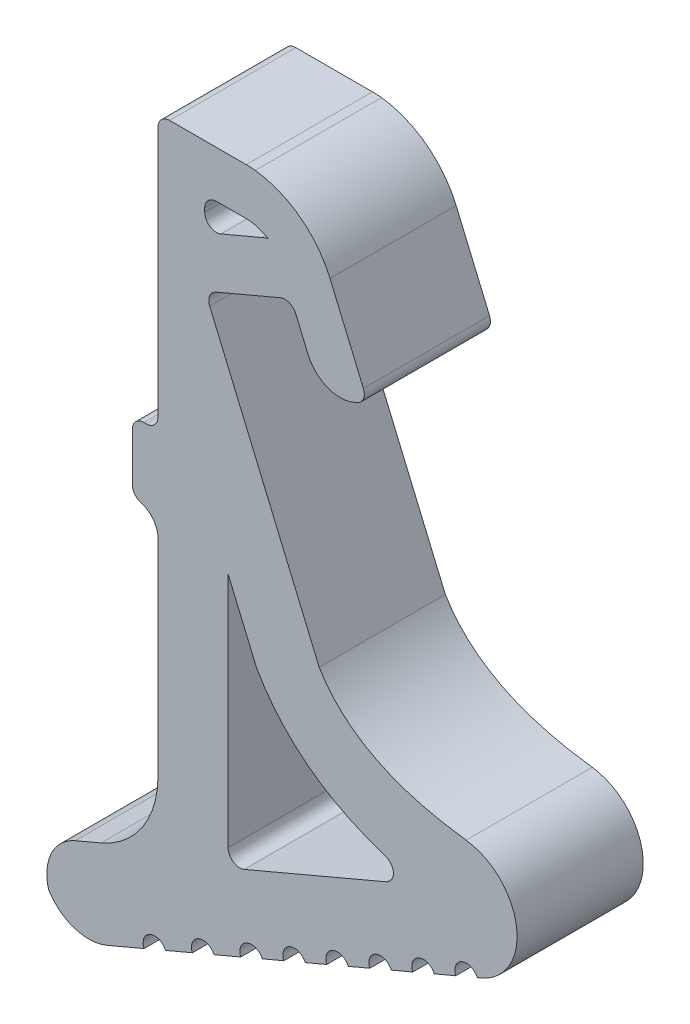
ISO-10303-21;
HEADER;
FILE_DESCRIPTION(('STEP AP214'),'2;1');
FILE_NAME('part.step','',(''),(''),'','','');
FILE_SCHEMA(('AUTOMOTIVE_DESIGN { 1 0 10303 214 1 1 1 1 }'));
ENDSEC;
DATA;
#1=APPLICATION_CONTEXT('core data for automotive mechanical design processes');
#2=APPLICATION_PROTOCOL_DEFINITION('international standard','automotive_design',2000,#1);
#3=PRODUCT_CONTEXT('',#1,'mechanical');
#4=PRODUCT('Part','Part','',(#3));
#5=PRODUCT_RELATED_PRODUCT_CATEGORY('part','',(#4));
#6=PRODUCT_DEFINITION_FORMATION('','',#4);
#7=PRODUCT_DEFINITION_CONTEXT('part definition',#1,'design');
#8=PRODUCT_DEFINITION('design','',#6,#7);
#9=PRODUCT_DEFINITION_SHAPE('','',#8);
#10=(LENGTH_UNIT() NAMED_UNIT(*) SI_UNIT(.MILLI.,.METRE.));
#11=(NAMED_UNIT(*) PLANE_ANGLE_UNIT() SI_UNIT($,.RADIAN.));
#12=(NAMED_UNIT(*) SI_UNIT($,.STERADIAN.) SOLID_ANGLE_UNIT());
#13=UNCERTAINTY_MEASURE_WITH_UNIT(LENGTH_MEASURE(1.E-05),#10,'distance_accuracy_value','');
#14=(GEOMETRIC_REPRESENTATION_CONTEXT(3) GLOBAL_UNCERTAINTY_ASSIGNED_CONTEXT((#13)) GLOBAL_UNIT_ASSIGNED_CONTEXT((#10,
#11,#12)) REPRESENTATION_CONTEXT('',''));
#15=CARTESIAN_POINT('',(0.,0.,0.));
#16=DIRECTION('',(0.,0.,1.));
#17=DIRECTION('',(1.,0.,0.));
#18=AXIS2_PLACEMENT_3D('',#15,#16,#17);
#19=CARTESIAN_POINT('',(0.,-31.,5.4));
#20=DIRECTION('',(-0.390731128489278,0.920504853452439,0.));
#21=DIRECTION('',(-0.920504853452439,-0.390731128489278,0.));
#22=AXIS2_PLACEMENT_3D('',#19,#20,#21);
#23=PLANE('',#22);
#24=DIRECTION('',(0.920504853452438,0.390731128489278,0.));
#25=VECTOR('',#24,1.);
#26=CARTESIAN_POINT('',(0.,-31.,-5.4));
#27=LINE('',#26,#25);
#28=CARTESIAN_POINT('',(-4.36432494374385,-32.8525460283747,-5.4));
#29=VERTEX_POINT('',#28);
#30=CARTESIAN_POINT('',(-1.19515049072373,-31.5073112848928,-5.4));
#31=VERTEX_POINT('',#30);
#32=EDGE_CURVE('E460',#29,#31,#27,.T.);
#33=ORIENTED_EDGE('',*,*,#32,.T.);
#34=DIRECTION('',(0.,0.,1.));
#35=VECTOR('',#34,1.);
#36=CARTESIAN_POINT('',(-1.19515049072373,-31.5073112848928,-5.41000000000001));
#37=LINE('',#36,#35);
#38=CARTESIAN_POINT('',(-1.19515049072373,-31.5073112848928,5.4));
#39=VERTEX_POINT('',#38);
#40=EDGE_CURVE('E53',#31,#39,#37,.T.);
#41=ORIENTED_EDGE('',*,*,#40,.T.);
#42=DIRECTION('',(0.920504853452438,0.390731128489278,0.));
#43=VECTOR('',#42,1.);
#44=CARTESIAN_POINT('',(0.,-31.,5.4));
#45=LINE('',#44,#43);
#46=CARTESIAN_POINT('',(-4.36432494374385,-32.8525460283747,5.4));
#47=VERTEX_POINT('',#46);
#48=EDGE_CURVE('E439',#47,#39,#45,.T.);
#49=ORIENTED_EDGE('',*,*,#48,.F.);
#50=DIRECTION('',(0.,0.,1.));
#51=VECTOR('',#50,1.);
#52=CARTESIAN_POINT('',(-4.36432494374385,-32.8525460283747,-5.4));
#53=LINE('',#52,#51);
#54=EDGE_CURVE('E711',#47,#29,#53,.F.);
#55=ORIENTED_EDGE('',*,*,#54,.T.);
#56=EDGE_LOOP('',(#33,#41,#49,#55));
#57=FACE_BOUND('',#56,.T.);
#58=ADVANCED_FACE('F39',(#57),#23,.F.);
#59=CARTESIAN_POINT('',(0.645859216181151,-30.7258490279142,5.4));
#60=VERTEX_POINT('',#59);
#61=CARTESIAN_POINT('',(2.94712134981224,-29.749021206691,5.4));
#62=VERTEX_POINT('',#61);
#63=EDGE_CURVE('E436',#60,#62,#45,.T.);
#64=ORIENTED_EDGE('',*,*,#63,.F.);
#65=DIRECTION('',(0.,0.,1.));
#66=VECTOR('',#65,1.);
#67=CARTESIAN_POINT('',(0.645859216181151,-30.7258490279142,-5.41000000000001));
#68=LINE('',#67,#66);
#69=CARTESIAN_POINT('',(0.645859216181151,-30.7258490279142,-5.4));
#70=VERTEX_POINT('',#69);
#71=EDGE_CURVE('E426',#60,#70,#68,.F.);
#72=ORIENTED_EDGE('',*,*,#71,.T.);
#73=CARTESIAN_POINT('',(2.94712134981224,-29.749021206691,-5.4));
#74=VERTEX_POINT('',#73);
#75=EDGE_CURVE('E61',#70,#74,#27,.T.);
#76=ORIENTED_EDGE('',*,*,#75,.T.);
#77=DIRECTION('',(0.,0.,1.));
#78=VECTOR('',#77,1.);
#79=CARTESIAN_POINT('',(2.94712134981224,-29.749021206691,-5.41000000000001));
#80=LINE('',#79,#78);
#81=EDGE_CURVE('E442',#74,#62,#80,.T.);
#82=ORIENTED_EDGE('',*,*,#81,.T.);
#83=EDGE_LOOP('',(#64,#72,#76,#82));
#84=FACE_BOUND('',#83,.T.);
#85=ADVANCED_FACE('F441',(#84),#23,.F.);
#86=CARTESIAN_POINT('',(23.6584805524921,-20.9575708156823,-5.4));
#87=VERTEX_POINT('',#86);
#88=CARTESIAN_POINT('',(25.499490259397,-20.1761085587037,-5.4));
#89=VERTEX_POINT('',#88);
#90=EDGE_CURVE('E725',#87,#89,#27,.T.);
#91=ORIENTED_EDGE('',*,*,#90,.T.);
#92=DIRECTION('',(0.,0.,1.));
#93=VECTOR('',#92,1.);
#94=CARTESIAN_POINT('',(25.499490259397,-20.1761085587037,-5.41000000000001));
#95=LINE('',#94,#93);
#96=CARTESIAN_POINT('',(25.499490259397,-20.1761085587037,5.4));
#97=VERTEX_POINT('',#96);
#98=EDGE_CURVE('E1720',#89,#97,#95,.T.);
#99=ORIENTED_EDGE('',*,*,#98,.T.);
#100=CARTESIAN_POINT('',(23.6584805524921,-20.9575708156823,5.4));
#101=VERTEX_POINT('',#100);
#102=EDGE_CURVE('E1050',#101,#97,#45,.T.);
#103=ORIENTED_EDGE('',*,*,#102,.F.);
#104=DIRECTION('',(0.,0.,1.));
#105=VECTOR('',#104,1.);
#106=CARTESIAN_POINT('',(23.6584805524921,-20.9575708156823,-5.41000000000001));
#107=LINE('',#106,#105);
#108=EDGE_CURVE('E1716',#101,#87,#107,.F.);
#109=ORIENTED_EDGE('',*,*,#108,.T.);
#110=EDGE_LOOP('',(#91,#99,#103,#109));
#111=FACE_BOUND('',#110,.T.);
#112=ADVANCED_FACE('F707',(#111),#23,.F.);
#113=CARTESIAN_POINT('',(19.9764611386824,-22.5204953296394,-5.4));
#114=VERTEX_POINT('',#113);
#115=CARTESIAN_POINT('',(21.8174708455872,-21.7390330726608,-5.4));
#116=VERTEX_POINT('',#115);
#117=EDGE_CURVE('E729',#114,#116,#27,.T.);
#118=ORIENTED_EDGE('',*,*,#117,.T.);
#119=DIRECTION('',(0.,0.,1.));
#120=VECTOR('',#119,1.);
#121=CARTESIAN_POINT('',(21.8174708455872,-21.7390330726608,-5.41000000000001));
#122=LINE('',#121,#120);
#123=CARTESIAN_POINT('',(21.8174708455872,-21.7390330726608,5.4));
#124=VERTEX_POINT('',#123);
#125=EDGE_CURVE('E1714',#116,#124,#122,.T.);
#126=ORIENTED_EDGE('',*,*,#125,.T.);
#127=CARTESIAN_POINT('',(19.9764611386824,-22.5204953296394,5.4));
#128=VERTEX_POINT('',#127);
#129=EDGE_CURVE('E1055',#128,#124,#45,.T.);
#130=ORIENTED_EDGE('',*,*,#129,.F.);
#131=DIRECTION('',(0.,0.,1.));
#132=VECTOR('',#131,1.);
#133=CARTESIAN_POINT('',(19.9764611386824,-22.5204953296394,-5.41000000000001));
#134=LINE('',#133,#132);
#135=EDGE_CURVE('E1710',#128,#114,#134,.F.);
#136=ORIENTED_EDGE('',*,*,#135,.T.);
#137=EDGE_LOOP('',(#118,#126,#130,#136));
#138=FACE_BOUND('',#137,.T.);
#139=ADVANCED_FACE('F1575',(#138),#23,.F.);
#140=CARTESIAN_POINT('',(16.2944417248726,-24.0834198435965,-5.4));
#141=VERTEX_POINT('',#140);
#142=CARTESIAN_POINT('',(18.1354514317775,-23.3019575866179,-5.4));
#143=VERTEX_POINT('',#142);
#144=EDGE_CURVE('E735',#141,#143,#27,.T.);
#145=ORIENTED_EDGE('',*,*,#144,.T.);
#146=DIRECTION('',(0.,0.,1.));
#147=VECTOR('',#146,1.);
#148=CARTESIAN_POINT('',(18.1354514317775,-23.3019575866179,-5.41000000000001));
#149=LINE('',#148,#147);
#150=CARTESIAN_POINT('',(18.1354514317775,-23.3019575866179,5.4));
#151=VERTEX_POINT('',#150);
#152=EDGE_CURVE('E1708',#143,#151,#149,.T.);
#153=ORIENTED_EDGE('',*,*,#152,.T.);
#154=CARTESIAN_POINT('',(16.2944417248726,-24.0834198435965,5.4));
#155=VERTEX_POINT('',#154);
#156=EDGE_CURVE('E1059',#155,#151,#45,.T.);
#157=ORIENTED_EDGE('',*,*,#156,.F.);
#158=DIRECTION('',(0.,0.,1.));
#159=VECTOR('',#158,1.);
#160=CARTESIAN_POINT('',(16.2944417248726,-24.0834198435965,-5.41000000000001));
#161=LINE('',#160,#159);
#162=EDGE_CURVE('E1702',#155,#141,#161,.F.);
#163=ORIENTED_EDGE('',*,*,#162,.T.);
#164=EDGE_LOOP('',(#145,#153,#157,#163));
#165=FACE_BOUND('',#164,.T.);
#166=ADVANCED_FACE('F1571',(#165),#23,.F.);
#167=CARTESIAN_POINT('',(12.6124223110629,-25.6463443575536,-5.4));
#168=VERTEX_POINT('',#167);
#169=CARTESIAN_POINT('',(14.4534320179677,-24.8648821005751,-5.4));
#170=VERTEX_POINT('',#169);
#171=EDGE_CURVE('E724',#168,#170,#27,.T.);
#172=ORIENTED_EDGE('',*,*,#171,.T.);
#173=DIRECTION('',(0.,0.,1.));
#174=VECTOR('',#173,1.);
#175=CARTESIAN_POINT('',(14.4534320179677,-24.8648821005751,-5.41000000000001));
#176=LINE('',#175,#174);
#177=CARTESIAN_POINT('',(14.4534320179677,-24.8648821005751,5.4));
#178=VERTEX_POINT('',#177);
#179=EDGE_CURVE('E752',#170,#178,#176,.T.);
#180=ORIENTED_EDGE('',*,*,#179,.T.);
#181=CARTESIAN_POINT('',(12.6124223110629,-25.6463443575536,5.4));
#182=VERTEX_POINT('',#181);
#183=EDGE_CURVE('E1063',#182,#178,#45,.T.);
#184=ORIENTED_EDGE('',*,*,#183,.F.);
#185=DIRECTION('',(0.,0.,1.));
#186=VECTOR('',#185,1.);
#187=CARTESIAN_POINT('',(12.6124223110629,-25.6463443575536,-5.41000000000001));
#188=LINE('',#187,#186);
#189=EDGE_CURVE('E754',#182,#168,#188,.F.);
#190=ORIENTED_EDGE('',*,*,#189,.T.);
#191=EDGE_LOOP('',(#172,#180,#184,#190));
#192=FACE_BOUND('',#191,.T.);
#193=ADVANCED_FACE('F750',(#192),#23,.F.);
#194=CARTESIAN_POINT('',(8.9304028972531,-27.2092688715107,-5.4));
#195=VERTEX_POINT('',#194);
#196=CARTESIAN_POINT('',(10.771412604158,-26.4278066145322,-5.4));
#197=VERTEX_POINT('',#196);
#198=EDGE_CURVE('E464',#195,#197,#27,.T.);
#199=ORIENTED_EDGE('',*,*,#198,.T.);
#200=DIRECTION('',(0.,0.,1.));
#201=VECTOR('',#200,1.);
#202=CARTESIAN_POINT('',(10.771412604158,-26.4278066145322,-5.41000000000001));
#203=LINE('',#202,#201);
#204=CARTESIAN_POINT('',(10.771412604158,-26.4278066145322,5.4));
#205=VERTEX_POINT('',#204);
#206=EDGE_CURVE('E1077',#197,#205,#203,.T.);
#207=ORIENTED_EDGE('',*,*,#206,.T.);
#208=CARTESIAN_POINT('',(8.9304028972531,-27.2092688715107,5.4));
#209=VERTEX_POINT('',#208);
#210=EDGE_CURVE('E446',#209,#205,#45,.T.);
#211=ORIENTED_EDGE('',*,*,#210,.F.);
#212=DIRECTION('',(0.,0.,1.));
#213=VECTOR('',#212,1.);
#214=CARTESIAN_POINT('',(8.9304028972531,-27.2092688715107,-5.41000000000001));
#215=LINE('',#214,#213);
#216=EDGE_CURVE('E1076',#209,#195,#215,.F.);
#217=ORIENTED_EDGE('',*,*,#216,.T.);
#218=EDGE_LOOP('',(#199,#207,#211,#217));
#219=FACE_BOUND('',#218,.T.);
#220=ADVANCED_FACE('F1075',(#219),#23,.F.);
#221=CARTESIAN_POINT('',(4.78813105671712,-28.9675589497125,5.4));
#222=VERTEX_POINT('',#221);
#223=CARTESIAN_POINT('',(7.08939319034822,-27.9907311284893,5.4));
#224=VERTEX_POINT('',#223);
#225=EDGE_CURVE('E443',#222,#224,#45,.T.);
#226=ORIENTED_EDGE('',*,*,#225,.F.);
#227=DIRECTION('',(0.,0.,1.));
#228=VECTOR('',#227,1.);
#229=CARTESIAN_POINT('',(4.78813105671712,-28.9675589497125,-5.41000000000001));
#230=LINE('',#229,#228);
#231=CARTESIAN_POINT('',(4.78813105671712,-28.9675589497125,-5.4));
#232=VERTEX_POINT('',#231);
#233=EDGE_CURVE('E807',#222,#232,#230,.F.);
#234=ORIENTED_EDGE('',*,*,#233,.T.);
#235=CARTESIAN_POINT('',(7.08939319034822,-27.9907311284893,-5.4));
#236=VERTEX_POINT('',#235);
#237=EDGE_CURVE('E718',#232,#236,#27,.T.);
#238=ORIENTED_EDGE('',*,*,#237,.T.);
#239=DIRECTION('',(0.,0.,1.));
#240=VECTOR('',#239,1.);
#241=CARTESIAN_POINT('',(7.08939319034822,-27.9907311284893,-5.41000000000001));
#242=LINE('',#241,#240);
#243=EDGE_CURVE('E1085',#236,#224,#242,.T.);
#244=ORIENTED_EDGE('',*,*,#243,.T.);
#245=EDGE_LOOP('',(#226,#234,#238,#244));
#246=FACE_BOUND('',#245,.T.);
#247=ADVANCED_FACE('F613',(#246),#23,.F.);
#248=CARTESIAN_POINT('',(0.,31.,5.4));
#249=DIRECTION('',(1.,0.,0.));
#250=DIRECTION('',(0.,0.,-1.));
#251=AXIS2_PLACEMENT_3D('',#248,#249,#250);
#252=PLANE('',#251);
#253=DIRECTION('',(0.,-1.,0.));
#254=VECTOR('',#253,1.);
#255=CARTESIAN_POINT('',(0.,31.,-5.4));
#256=LINE('',#255,#254);
#257=CARTESIAN_POINT('',(0.,-0.5,-5.4));
#258=VERTEX_POINT('',#257);
#259=CARTESIAN_POINT('',(0.,-18.15073954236,-5.4));
#260=VERTEX_POINT('',#259);
#261=EDGE_CURVE('E454',#258,#260,#256,.T.);
#262=ORIENTED_EDGE('',*,*,#261,.T.);
#263=DIRECTION('',(0.,0.,1.));
#264=VECTOR('',#263,1.);
#265=CARTESIAN_POINT('',(0.,-18.15073954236,5.4));
#266=LINE('',#265,#264);
#267=CARTESIAN_POINT('',(0.,-18.15073954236,5.4));
#268=VERTEX_POINT('',#267);
#269=EDGE_CURVE('E793',#260,#268,#266,.T.);
#270=ORIENTED_EDGE('',*,*,#269,.T.);
#271=DIRECTION('',(0.,-1.,0.));
#272=VECTOR('',#271,1.);
#273=CARTESIAN_POINT('',(0.,31.,5.4));
#274=LINE('',#273,#272);
#275=CARTESIAN_POINT('',(0.,-0.5,5.4));
#276=VERTEX_POINT('',#275);
#277=EDGE_CURVE('E1043',#276,#268,#274,.T.);
#278=ORIENTED_EDGE('',*,*,#277,.F.);
#279=DIRECTION('',(0.,0.,1.));
#280=VECTOR('',#279,1.);
#281=CARTESIAN_POINT('',(0.,-0.500000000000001,-5.4));
#282=LINE('',#281,#280);
#283=EDGE_CURVE('E476',#276,#258,#282,.F.);
#284=ORIENTED_EDGE('',*,*,#283,.T.);
#285=EDGE_LOOP('',(#262,#270,#278,#284));
#286=FACE_BOUND('',#285,.T.);
#287=ADVANCED_FACE('F614',(#286),#252,.F.);
#288=CARTESIAN_POINT('',(0.,26.,0.));
#289=DIRECTION('',(1.,0.,0.));
#290=DIRECTION('',(0.,0.,-1.));
#291=AXIS2_PLACEMENT_3D('',#288,#289,#290);
#292=CIRCLE('',#291,2.19979870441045);
#293=CARTESIAN_POINT('',(0.,26.,-2.19979870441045));
#294=VERTEX_POINT('',#293);
#295=EDGE_CURVE('E467',#294,#294,#292,.T.);
#296=ORIENTED_EDGE('',*,*,#295,.T.);
#297=EDGE_LOOP('',(#296));
#298=FACE_BOUND('',#297,.T.);
#299=CARTESIAN_POINT('',(0.,13.,0.));
#300=DIRECTION('',(1.,0.,0.));
#301=DIRECTION('',(0.,0.,-1.));
#302=AXIS2_PLACEMENT_3D('',#299,#300,#301);
#303=CIRCLE('',#302,2.19979870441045);
#304=CARTESIAN_POINT('',(0.,13.,-2.19979870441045));
#305=VERTEX_POINT('',#304);
#306=EDGE_CURVE('E470',#305,#305,#303,.T.);
#307=ORIENTED_EDGE('',*,*,#306,.T.);
#308=EDGE_LOOP('',(#307));
#309=FACE_BOUND('',#308,.T.);
#310=CARTESIAN_POINT('',(0.,30.,5.4));
#311=VERTEX_POINT('',#310);
#312=CARTESIAN_POINT('',(0.,8.5,5.4));
#313=VERTEX_POINT('',#312);
#314=EDGE_CURVE('E450',#311,#313,#274,.T.);
#315=ORIENTED_EDGE('',*,*,#314,.F.);
#316=DIRECTION('',(0.,0.,-1.));
#317=VECTOR('',#316,1.);
#318=CARTESIAN_POINT('',(0.,30.,5.4));
#319=LINE('',#318,#317);
#320=CARTESIAN_POINT('',(0.,30.,-5.4));
#321=VERTEX_POINT('',#320);
#322=EDGE_CURVE('E485',#311,#321,#319,.T.);
#323=ORIENTED_EDGE('',*,*,#322,.T.);
#324=CARTESIAN_POINT('',(0.,8.5,-5.4));
#325=VERTEX_POINT('',#324);
#326=EDGE_CURVE('E456',#321,#325,#256,.T.);
#327=ORIENTED_EDGE('',*,*,#326,.T.);
#328=DIRECTION('',(0.,0.,-1.));
#329=VECTOR('',#328,1.);
#330=CARTESIAN_POINT('',(0.,8.5,5.4));
#331=LINE('',#330,#329);
#332=EDGE_CURVE('E483',#325,#313,#331,.F.);
#333=ORIENTED_EDGE('',*,*,#332,.T.);
#334=EDGE_LOOP('',(#315,#323,#327,#333));
#335=FACE_BOUND('',#334,.T.);
#336=ADVANCED_FACE('F617',(#298,#309,#335),#252,.F.);
#337=CARTESIAN_POINT('',(0.,31.,5.4));
#338=DIRECTION('',(0.,-1.,0.));
#339=DIRECTION('',(1.,0.,0.));
#340=AXIS2_PLACEMENT_3D('',#337,#338,#339);
#341=PLANE('',#340);
#342=DIRECTION('',(-1.,0.,0.));
#343=VECTOR('',#342,1.);
#344=CARTESIAN_POINT('',(0.,31.,5.4));
#345=LINE('',#344,#343);
#346=CARTESIAN_POINT('',(7.56203741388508,31.,5.4));
#347=VERTEX_POINT('',#346);
#348=CARTESIAN_POINT('',(1.00000000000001,31.,5.4));
#349=VERTEX_POINT('',#348);
#350=EDGE_CURVE('E463',#347,#349,#345,.T.);
#351=ORIENTED_EDGE('',*,*,#350,.F.);
#352=DIRECTION('',(0.,0.,-1.));
#353=VECTOR('',#352,1.);
#354=CARTESIAN_POINT('',(7.56203741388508,31.,-5.4));
#355=LINE('',#354,#353);
#356=CARTESIAN_POINT('',(7.56203741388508,31.,-5.4));
#357=VERTEX_POINT('',#356);
#358=EDGE_CURVE('E533',#347,#357,#355,.T.);
#359=ORIENTED_EDGE('',*,*,#358,.T.);
#360=DIRECTION('',(-1.,0.,0.));
#361=VECTOR('',#360,1.);
#362=CARTESIAN_POINT('',(0.,31.,-5.4));
#363=LINE('',#362,#361);
#364=CARTESIAN_POINT('',(1.00000000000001,31.,-5.4));
#365=VERTEX_POINT('',#364);
#366=EDGE_CURVE('E452',#357,#365,#363,.T.);
#367=ORIENTED_EDGE('',*,*,#366,.T.);
#368=DIRECTION('',(0.,0.,-1.));
#369=VECTOR('',#368,1.);
#370=CARTESIAN_POINT('',(1.00000000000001,31.,5.4));
#371=LINE('',#370,#369);
#372=EDGE_CURVE('E495',#365,#349,#371,.F.);
#373=ORIENTED_EDGE('',*,*,#372,.T.);
#374=EDGE_LOOP('',(#351,#359,#367,#373));
#375=FACE_BOUND('',#374,.T.);
#376=ADVANCED_FACE('F611',(#375),#341,.F.);
#377=CARTESIAN_POINT('',(27.3404999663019,-19.3946463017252,5.4));
#378=VERTEX_POINT('',#377);
#379=CARTESIAN_POINT('',(27.703309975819,-19.2406425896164,5.4));
#380=VERTEX_POINT('',#379);
#381=EDGE_CURVE('E447',#378,#380,#45,.T.);
#382=ORIENTED_EDGE('',*,*,#381,.F.);
#383=DIRECTION('',(0.,0.,1.));
#384=VECTOR('',#383,1.);
#385=CARTESIAN_POINT('',(27.3404999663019,-19.3946463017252,-5.41000000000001));
#386=LINE('',#385,#384);
#387=CARTESIAN_POINT('',(27.3404999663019,-19.3946463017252,-5.4));
#388=VERTEX_POINT('',#387);
#389=EDGE_CURVE('E1722',#378,#388,#386,.F.);
#390=ORIENTED_EDGE('',*,*,#389,.T.);
#391=CARTESIAN_POINT('',(27.703309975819,-19.2406425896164,-5.4));
#392=VERTEX_POINT('',#391);
#393=EDGE_CURVE('E459',#388,#392,#27,.T.);
#394=ORIENTED_EDGE('',*,*,#393,.T.);
#395=DIRECTION('',(0.,0.,-1.));
#396=VECTOR('',#395,1.);
#397=CARTESIAN_POINT('',(27.703309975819,-19.2406425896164,5.4));
#398=LINE('',#397,#396);
#399=EDGE_CURVE('E570',#392,#380,#398,.F.);
#400=ORIENTED_EDGE('',*,*,#399,.T.);
#401=EDGE_LOOP('',(#382,#390,#394,#400));
#402=FACE_BOUND('',#401,.T.);
#403=ADVANCED_FACE('F608',(#402),#23,.F.);
#404=CARTESIAN_POINT('',(0.,0.,5.4));
#405=DIRECTION('',(0.,0.,-1.));
#406=DIRECTION('',(-1.,0.,0.));
#407=AXIS2_PLACEMENT_3D('',#404,#405,#406);
#408=PLANE('',#407);
#409=DIRECTION('',(0.920504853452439,0.390731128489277,0.));
#410=VECTOR('',#409,1.);
#411=CARTESIAN_POINT('',(5.3907311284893,24.7758894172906,5.4));
#412=LINE('',#411,#410);
#413=CARTESIAN_POINT('',(5.3907311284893,24.7758894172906,5.4));
#414=VERTEX_POINT('',#413);
#415=CARTESIAN_POINT('',(8.91976117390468,26.2738737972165,5.4));
#416=VERTEX_POINT('',#415);
#417=EDGE_CURVE('E1115',#414,#416,#412,.T.);
#418=ORIENTED_EDGE('',*,*,#417,.F.);
#419=CARTESIAN_POINT('',(5.00000000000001,25.696394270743,5.4));
#420=DIRECTION('',(0.,0.,1.));
#421=DIRECTION('',(-1.,0.,0.));
#422=AXIS2_PLACEMENT_3D('',#419,#420,#421);
#423=CIRCLE('',#422,1.);
#424=CARTESIAN_POINT('',(4.00000000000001,25.6963942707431,5.4));
#425=VERTEX_POINT('',#424);
#426=EDGE_CURVE('E1087',#425,#414,#423,.T.);
#427=ORIENTED_EDGE('',*,*,#426,.F.);
#428=DIRECTION('',(0.,-1.,0.));
#429=VECTOR('',#428,1.);
#430=CARTESIAN_POINT('',(4.00000000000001,26.,5.4));
#431=LINE('',#430,#429);
#432=CARTESIAN_POINT('',(4.00000000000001,26.,5.4));
#433=VERTEX_POINT('',#432);
#434=EDGE_CURVE('E1092',#433,#425,#431,.T.);
#435=ORIENTED_EDGE('',*,*,#434,.F.);
#436=CARTESIAN_POINT('',(5.00000000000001,26.,5.4));
#437=DIRECTION('',(0.,0.,1.));
#438=DIRECTION('',(1.,0.,0.));
#439=AXIS2_PLACEMENT_3D('',#436,#437,#438);
#440=CIRCLE('',#439,1.);
#441=CARTESIAN_POINT('',(5.00000000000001,27.,5.4));
#442=VERTEX_POINT('',#441);
#443=EDGE_CURVE('E1130',#442,#433,#440,.T.);
#444=ORIENTED_EDGE('',*,*,#443,.F.);
#445=DIRECTION('',(-1.,0.,0.));
#446=VECTOR('',#445,1.);
#447=CARTESIAN_POINT('',(7.56203741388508,27.,5.4));
#448=LINE('',#447,#446);
#449=CARTESIAN_POINT('',(7.56203741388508,27.,5.4));
#450=VERTEX_POINT('',#449);
#451=EDGE_CURVE('E1127',#450,#442,#448,.T.);
#452=ORIENTED_EDGE('',*,*,#451,.F.);
#453=CARTESIAN_POINT('',(7.56203741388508,23.,5.4));
#454=DIRECTION('',(0.,0.,1.));
#455=DIRECTION('',(1.,0.,0.));
#456=AXIS2_PLACEMENT_3D('',#453,#454,#455);
#457=CIRCLE('',#456,4.);
#458=CARTESIAN_POINT('',(7.90113241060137,26.9856009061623,5.4));
#459=VERTEX_POINT('',#458);
#460=EDGE_CURVE('E1124',#459,#450,#457,.T.);
#461=ORIENTED_EDGE('',*,*,#460,.F.);
#462=CARTESIAN_POINT('',(7.36718179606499,23.0213990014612,5.4));
#463=DIRECTION('',(0.,0.,1.));
#464=DIRECTION('',(1.,0.,0.));
#465=AXIS2_PLACEMENT_3D('',#462,#463,#464);
#466=CIRCLE('',#465,4.);
#467=CARTESIAN_POINT('',(9.41891118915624,26.4551151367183,5.4));
#468=VERTEX_POINT('',#467);
#469=EDGE_CURVE('E1121',#468,#459,#466,.T.);
#470=ORIENTED_EDGE('',*,*,#469,.F.);
#471=CARTESIAN_POINT('',(10.8734168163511,21.6713495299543,5.4));
#472=DIRECTION('',(0.,0.,-1.));
#473=DIRECTION('',(1.,0.,0.));
#474=AXIS2_PLACEMENT_3D('',#471,#472,#473);
#475=CIRCLE('',#474,5.);
#476=EDGE_CURVE('E1118',#416,#468,#475,.T.);
#477=ORIENTED_EDGE('',*,*,#476,.F.);
#478=EDGE_LOOP('',(#418,#427,#435,#444,#452,#461,#470,#477));
#479=FACE_BOUND('',#478,.T.);
#480=CARTESIAN_POINT('',(19.4662373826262,-14.3104174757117,5.4));
#481=CARTESIAN_POINT('',(19.0226961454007,-14.1678485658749,5.4));
#482=CARTESIAN_POINT('',(18.5835333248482,-14.0140574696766,5.4));
#483=CARTESIAN_POINT('',(16.8315019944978,-13.3446882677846,5.4));
#484=CARTESIAN_POINT('',(15.5564698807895,-12.729466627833,5.4));
#485=CARTESIAN_POINT('',(13.1260378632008,-11.2031334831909,5.4));
#486=CARTESIAN_POINT('',(12.0173983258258,-10.3205035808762,5.4));
#487=CARTESIAN_POINT('',(10.5313819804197,-8.7982204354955,5.4));
#488=CARTESIAN_POINT('',(10.0640785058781,-8.25553894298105,5.4));
#489=CARTESIAN_POINT('',(9.41620337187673,-7.39501291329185,5.4));
#490=CARTESIAN_POINT('',(9.2099363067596,-7.10165968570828,5.4));
#491=CARTESIAN_POINT('',(8.81670361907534,-6.50198533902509,5.4));
#492=CARTESIAN_POINT('',(8.63286729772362,-6.19356176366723,5.4));
#493=CARTESIAN_POINT('',(8.4480474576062,-5.88579897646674,5.4));
#494=B_SPLINE_CURVE_WITH_KNOTS('',3,(#480,#481,#482,#483,#484,#485,#486,#487,#488,#489,#490,
#491,#492,#493),.UNSPECIFIED.,.F.,.F.,(4,2,2,2,2,2,4),(0.167576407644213,0.25,0.5,0.75,0.875,
0.9375,1.),.UNSPECIFIED.);
#495=CARTESIAN_POINT('',(19.4662373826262,-14.3104174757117,5.4));
#496=VERTEX_POINT('',#495);
#497=CARTESIAN_POINT('',(8.4480474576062,-5.88579897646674,5.4));
#498=VERTEX_POINT('',#497);
#499=EDGE_CURVE('E944',#496,#498,#494,.T.);
#500=ORIENTED_EDGE('',*,*,#499,.F.);
#501=CARTESIAN_POINT('',(19.1602241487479,-15.2624447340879,5.4));
#502=DIRECTION('',(0.,0.,1.));
#503=DIRECTION('',(1.,0.,0.));
#504=AXIS2_PLACEMENT_3D('',#501,#502,#503);
#505=CIRCLE('',#504,1.00000000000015);
#506=CARTESIAN_POINT('',(19.5509552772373,-16.1829495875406,5.4));
#507=VERTEX_POINT('',#506);
#508=EDGE_CURVE('E949',#507,#496,#505,.T.);
#509=ORIENTED_EDGE('',*,*,#508,.F.);
#510=DIRECTION('',(0.920504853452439,0.390731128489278,0.));
#511=VECTOR('',#510,1.);
#512=CARTESIAN_POINT('',(7.3907311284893,-21.3446584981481,5.4));
#513=LINE('',#512,#511);
#514=CARTESIAN_POINT('',(7.3907311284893,-21.3446584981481,5.4));
#515=VERTEX_POINT('',#514);
#516=EDGE_CURVE('E904',#515,#507,#513,.T.);
#517=ORIENTED_EDGE('',*,*,#516,.F.);
#518=CARTESIAN_POINT('',(7.00000000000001,-20.4241536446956,5.4));
#519=DIRECTION('',(0.,0.,1.));
#520=DIRECTION('',(-1.,0.,0.));
#521=AXIS2_PLACEMENT_3D('',#518,#519,#520);
#522=CIRCLE('',#521,1.);
#523=CARTESIAN_POINT('',(6.00000000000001,-20.4241536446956,5.4));
#524=VERTEX_POINT('',#523);
#525=EDGE_CURVE('E901',#524,#515,#522,.T.);
#526=ORIENTED_EDGE('',*,*,#525,.F.);
#527=DIRECTION('',(0.,-1.,0.));
#528=VECTOR('',#527,1.);
#529=CARTESIAN_POINT('',(6.00000000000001,-0.499999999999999,5.4));
#530=LINE('',#529,#528);
#531=CARTESIAN_POINT('',(6.00000000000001,-0.499999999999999,5.4));
#532=VERTEX_POINT('',#531);
#533=EDGE_CURVE('E897',#532,#524,#530,.T.);
#534=ORIENTED_EDGE('',*,*,#533,.F.);
#535=CARTESIAN_POINT('',(-1.99999999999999,-0.5,5.4));
#536=DIRECTION('',(0.,0.,-1.));
#537=DIRECTION('',(1.,0.,0.));
#538=AXIS2_PLACEMENT_3D('',#535,#536,#537);
#539=CIRCLE('',#538,8.);
#540=CARTESIAN_POINT('',(5.9897069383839,-0.0943116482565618,5.4));
#541=VERTEX_POINT('',#540);
#542=EDGE_CURVE('E894',#541,#532,#539,.T.);
#543=ORIENTED_EDGE('',*,*,#542,.F.);
#544=DIRECTION('',(-0.390731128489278,0.920504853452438,0.));
#545=VECTOR('',#544,1.);
#546=CARTESIAN_POINT('',(8.4480474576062,-5.88579897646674,5.4));
#547=LINE('',#546,#545);
#548=EDGE_CURVE('E898',#498,#541,#547,.T.);
#549=ORIENTED_EDGE('',*,*,#548,.F.);
#550=EDGE_LOOP('',(#500,#509,#517,#526,#534,#543,#549));
#551=FACE_BOUND('',#550,.T.);
#552=ORIENTED_EDGE('',*,*,#48,.T.);
#553=CARTESIAN_POINT('',(-0.27464563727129,-31.1165801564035,5.4));
#554=DIRECTION('',(0.,0.,1.));
#555=DIRECTION('',(1.,0.,0.));
#556=AXIS2_PLACEMENT_3D('',#553,#554,#555);
#557=CIRCLE('',#556,1.);
#558=EDGE_CURVE('E429',#60,#39,#557,.T.);
#559=ORIENTED_EDGE('',*,*,#558,.F.);
#560=ORIENTED_EDGE('',*,*,#63,.T.);
#561=CARTESIAN_POINT('',(3.86762620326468,-29.3582900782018,5.4));
#562=DIRECTION('',(0.,0.,1.));
#563=DIRECTION('',(1.,0.,0.));
#564=AXIS2_PLACEMENT_3D('',#561,#562,#563);
#565=CIRCLE('',#564,1.);
#566=EDGE_CURVE('E809',#222,#62,#565,.T.);
#567=ORIENTED_EDGE('',*,*,#566,.F.);
#568=ORIENTED_EDGE('',*,*,#225,.T.);
#569=CARTESIAN_POINT('',(8.00989804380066,-27.6,5.4));
#570=DIRECTION('',(0.,0.,1.));
#571=DIRECTION('',(1.,0.,0.));
#572=AXIS2_PLACEMENT_3D('',#569,#570,#571);
#573=CIRCLE('',#572,1.);
#574=EDGE_CURVE('E1072',#209,#224,#573,.T.);
#575=ORIENTED_EDGE('',*,*,#574,.F.);
#576=ORIENTED_EDGE('',*,*,#210,.T.);
#577=CARTESIAN_POINT('',(11.6919174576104,-26.0370754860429,5.4));
#578=DIRECTION('',(0.,0.,1.));
#579=DIRECTION('',(1.,0.,0.));
#580=AXIS2_PLACEMENT_3D('',#577,#578,#579);
#581=CIRCLE('',#580,1.);
#582=EDGE_CURVE('E1070',#182,#205,#581,.T.);
#583=ORIENTED_EDGE('',*,*,#582,.F.);
#584=ORIENTED_EDGE('',*,*,#183,.T.);
#585=CARTESIAN_POINT('',(15.3739368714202,-24.4741509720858,5.4));
#586=DIRECTION('',(0.,0.,1.));
#587=DIRECTION('',(1.,0.,0.));
#588=AXIS2_PLACEMENT_3D('',#585,#586,#587);
#589=CIRCLE('',#588,1.);
#590=EDGE_CURVE('E1706',#155,#178,#589,.T.);
#591=ORIENTED_EDGE('',*,*,#590,.F.);
#592=ORIENTED_EDGE('',*,*,#156,.T.);
#593=CARTESIAN_POINT('',(19.0559562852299,-22.9112264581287,5.4));
#594=DIRECTION('',(0.,0.,1.));
#595=DIRECTION('',(1.,0.,0.));
#596=AXIS2_PLACEMENT_3D('',#593,#594,#595);
#597=CIRCLE('',#596,1.);
#598=EDGE_CURVE('E1712',#128,#151,#597,.T.);
#599=ORIENTED_EDGE('',*,*,#598,.F.);
#600=ORIENTED_EDGE('',*,*,#129,.T.);
#601=CARTESIAN_POINT('',(22.7379756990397,-21.3483019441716,5.4));
#602=DIRECTION('',(0.,0.,1.));
#603=DIRECTION('',(1.,0.,0.));
#604=AXIS2_PLACEMENT_3D('',#601,#602,#603);
#605=CIRCLE('',#604,1.);
#606=EDGE_CURVE('E1718',#101,#124,#605,.T.);
#607=ORIENTED_EDGE('',*,*,#606,.F.);
#608=ORIENTED_EDGE('',*,*,#102,.T.);
#609=CARTESIAN_POINT('',(26.4199951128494,-19.7853774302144,5.4));
#610=DIRECTION('',(0.,0.,1.));
#611=DIRECTION('',(1.,0.,0.));
#612=AXIS2_PLACEMENT_3D('',#609,#610,#611);
#613=CIRCLE('',#612,1.);
#614=EDGE_CURVE('E1724',#378,#97,#613,.T.);
#615=ORIENTED_EDGE('',*,*,#614,.F.);
#616=ORIENTED_EDGE('',*,*,#381,.T.);
#617=CARTESIAN_POINT('',(25.7496543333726,-14.6381183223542,5.4));
#618=DIRECTION('',(0.,0.,-1.));
#619=DIRECTION('',(-1.,0.,0.));
#620=AXIS2_PLACEMENT_3D('',#617,#618,#619);
#621=CIRCLE('',#620,5.);
#622=CARTESIAN_POINT('',(26.3839909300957,-9.67851984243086,5.4));
#623=VERTEX_POINT('',#622);
#624=EDGE_CURVE('E573',#380,#623,#621,.F.);
#625=ORIENTED_EDGE('',*,*,#624,.T.);
#626=CARTESIAN_POINT('',(45.6654730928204,-11.6161567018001,5.4));
#627=CARTESIAN_POINT('',(43.0044609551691,-10.4837282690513,5.4));
#628=CARTESIAN_POINT('',(37.8838512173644,-15.1220336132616,5.4));
#629=CARTESIAN_POINT('',(31.4527842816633,-10.0969830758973,5.4));
#630=CARTESIAN_POINT('',(24.5272564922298,-9.66554642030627,5.4));
#631=CARTESIAN_POINT('',(16.8963971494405,-8.29964626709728,5.4));
#632=CARTESIAN_POINT('',(13.8074299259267,-3.15588485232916,5.4));
#633=B_SPLINE_CURVE_WITH_KNOTS('',3,(#626,#627,#628,#629,#630,#631,#632),.UNSPECIFIED.,.F.,.F.,
(4,1,1,1,4),(0.,0.373946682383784,0.510329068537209,0.574639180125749,1.),.UNSPECIFIED.);
#634=CARTESIAN_POINT('',(13.8074299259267,-3.15588485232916,5.4));
#635=VERTEX_POINT('',#634);
#636=EDGE_CURVE('E910',#623,#635,#633,.T.);
#637=ORIENTED_EDGE('',*,*,#636,.T.);
#638=DIRECTION('',(0.390731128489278,-0.920504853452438,0.));
#639=VECTOR('',#638,1.);
#640=CARTESIAN_POINT('',(4.03915171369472,19.8567364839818,5.4));
#641=LINE('',#640,#639);
#642=CARTESIAN_POINT('',(4.429882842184,18.9362316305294,5.4));
#643=VERTEX_POINT('',#642);
#644=EDGE_CURVE('E1801',#643,#635,#641,.T.);
#645=ORIENTED_EDGE('',*,*,#644,.F.);
#646=CARTESIAN_POINT('',(5.35038769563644,19.3269627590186,5.4));
#647=DIRECTION('',(0.,0.,-1.));
#648=DIRECTION('',(-1.,0.,0.));
#649=AXIS2_PLACEMENT_3D('',#646,#647,#648);
#650=CIRCLE('',#649,1.);
#651=CARTESIAN_POINT('',(4.95965656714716,20.2474676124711,5.4));
#652=VERTEX_POINT('',#651);
#653=EDGE_CURVE('E561',#643,#652,#650,.T.);
#654=ORIENTED_EDGE('',*,*,#653,.T.);
#655=DIRECTION('',(-0.920504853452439,-0.390731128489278,0.));
#656=VECTOR('',#655,1.);
#657=CARTESIAN_POINT('',(11.4031905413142,22.982585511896,5.4));
#658=LINE('',#657,#656);
#659=CARTESIAN_POINT('',(10.4826856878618,22.5918543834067,5.4));
#660=VERTEX_POINT('',#659);
#661=EDGE_CURVE('E1798',#660,#652,#658,.T.);
#662=ORIENTED_EDGE('',*,*,#661,.F.);
#663=CARTESIAN_POINT('',(10.8734168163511,21.6713495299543,5.4));
#664=DIRECTION('',(0.,0.,-1.));
#665=DIRECTION('',(-1.,0.,0.));
#666=AXIS2_PLACEMENT_3D('',#663,#664,#665);
#667=CIRCLE('',#666,1.);
#668=CARTESIAN_POINT('',(11.7939216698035,22.0620806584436,5.4));
#669=VERTEX_POINT('',#668);
#670=EDGE_CURVE('E565',#660,#669,#667,.T.);
#671=ORIENTED_EDGE('',*,*,#670,.T.);
#672=DIRECTION('',(-0.390731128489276,0.920504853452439,0.));
#673=VECTOR('',#672,1.);
#674=CARTESIAN_POINT('',(14.0210891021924,16.8152029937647,5.4));
#675=LINE('',#674,#673);
#676=CARTESIAN_POINT('',(12.8488957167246,19.576717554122,5.4));
#677=VERTEX_POINT('',#676);
#678=EDGE_CURVE('E978',#677,#669,#675,.T.);
#679=ORIENTED_EDGE('',*,*,#678,.F.);
#680=CARTESIAN_POINT('',(15.6104102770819,20.7489109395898,5.4));
#681=DIRECTION('',(0.,0.,-1.));
#682=DIRECTION('',(-1.,0.,0.));
#683=AXIS2_PLACEMENT_3D('',#680,#681,#682);
#684=CIRCLE('',#683,3.);
#685=CARTESIAN_POINT('',(16.7826036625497,17.9873963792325,5.4));
#686=VERTEX_POINT('',#685);
#687=EDGE_CURVE('E776',#677,#686,#684,.F.);
#688=ORIENTED_EDGE('',*,*,#687,.T.);
#689=DIRECTION('',(0.920504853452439,0.390731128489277,0.));
#690=VECTOR('',#689,1.);
#691=CARTESIAN_POINT('',(14.0210891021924,16.8152029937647,5.4));
#692=LINE('',#691,#690);
#693=CARTESIAN_POINT('',(17.0587551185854,18.1046157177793,5.4));
#694=VERTEX_POINT('',#693);
#695=EDGE_CURVE('E539',#686,#694,#692,.T.);
#696=ORIENTED_EDGE('',*,*,#695,.T.);
#697=CARTESIAN_POINT('',(16.6680239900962,19.0251205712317,5.4));
#698=DIRECTION('',(0.,0.,-1.));
#699=DIRECTION('',(-1.,0.,0.));
#700=AXIS2_PLACEMENT_3D('',#697,#698,#699);
#701=CIRCLE('',#700,1.);
#702=CARTESIAN_POINT('',(17.5885288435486,19.415851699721,5.4));
#703=VERTEX_POINT('',#702);
#704=EDGE_CURVE('E554',#694,#703,#701,.F.);
#705=ORIENTED_EDGE('',*,*,#704,.T.);
#706=DIRECTION('',(-0.390731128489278,0.920504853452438,0.));
#707=VECTOR('',#706,1.);
#708=CARTESIAN_POINT('',(17.9792599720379,18.4953468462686,5.4));
#709=LINE('',#708,#707);
#710=CARTESIAN_POINT('',(14.7312206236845,26.1472480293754,5.4));
#711=VERTEX_POINT('',#710);
#712=EDGE_CURVE('E1787',#703,#711,#709,.T.);
#713=ORIENTED_EDGE('',*,*,#712,.T.);
#714=CARTESIAN_POINT('',(7.36718179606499,23.0213990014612,5.4));
#715=DIRECTION('',(0.,0.,-1.));
#716=DIRECTION('',(-1.,0.,0.));
#717=AXIS2_PLACEMENT_3D('',#714,#715,#716);
#718=CIRCLE('',#717,8.);
#719=CARTESIAN_POINT('',(8.33785188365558,30.9622931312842,5.4));
#720=VERTEX_POINT('',#719);
#721=EDGE_CURVE('E526',#711,#720,#718,.F.);
#722=ORIENTED_EDGE('',*,*,#721,.T.);
#723=CARTESIAN_POINT('',(7.56203741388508,23.,5.4));
#724=DIRECTION('',(0.,0.,-1.));
#725=DIRECTION('',(-1.,0.,0.));
#726=AXIS2_PLACEMENT_3D('',#723,#724,#725);
#727=CIRCLE('',#726,8.);
#728=EDGE_CURVE('E524',#720,#347,#727,.F.);
#729=ORIENTED_EDGE('',*,*,#728,.T.);
#730=ORIENTED_EDGE('',*,*,#350,.T.);
#731=CARTESIAN_POINT('',(1.00000000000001,30.,5.4));
#732=DIRECTION('',(0.,0.,-1.));
#733=DIRECTION('',(-1.,0.,0.));
#734=AXIS2_PLACEMENT_3D('',#731,#732,#733);
#735=CIRCLE('',#734,1.);
#736=EDGE_CURVE('E502',#349,#311,#735,.F.);
#737=ORIENTED_EDGE('',*,*,#736,.T.);
#738=ORIENTED_EDGE('',*,*,#314,.T.);
#739=CARTESIAN_POINT('',(-0.999999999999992,8.5,5.4));
#740=DIRECTION('',(0.,0.,-1.));
#741=DIRECTION('',(-1.,0.,0.));
#742=AXIS2_PLACEMENT_3D('',#739,#740,#741);
#743=CIRCLE('',#742,1.);
#744=CARTESIAN_POINT('',(-0.999999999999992,7.5,5.4));
#745=VERTEX_POINT('',#744);
#746=EDGE_CURVE('E519',#313,#745,#743,.T.);
#747=ORIENTED_EDGE('',*,*,#746,.T.);
#748=DIRECTION('',(1.,0.,0.));
#749=VECTOR('',#748,1.);
#750=CARTESIAN_POINT('',(-2.2,7.5,5.4));
#751=LINE('',#750,#749);
#752=CARTESIAN_POINT('',(-1.2,7.5,5.4));
#753=VERTEX_POINT('',#752);
#754=EDGE_CURVE('E1040',#753,#745,#751,.T.);
#755=ORIENTED_EDGE('',*,*,#754,.F.);
#756=CARTESIAN_POINT('',(-1.2,6.5,5.4));
#757=DIRECTION('',(0.,0.,-1.));
#758=DIRECTION('',(-1.,0.,0.));
#759=AXIS2_PLACEMENT_3D('',#756,#757,#758);
#760=CIRCLE('',#759,1.);
#761=CARTESIAN_POINT('',(-2.2,6.5,5.4));
#762=VERTEX_POINT('',#761);
#763=EDGE_CURVE('E498',#753,#762,#760,.F.);
#764=ORIENTED_EDGE('',*,*,#763,.T.);
#765=DIRECTION('',(0.,1.,0.));
#766=VECTOR('',#765,1.);
#767=CARTESIAN_POINT('',(-2.2,7.5,5.4));
#768=LINE('',#767,#766);
#769=CARTESIAN_POINT('',(-2.2,2.39136645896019,5.4));
#770=VERTEX_POINT('',#769);
#771=EDGE_CURVE('E1753',#770,#762,#768,.T.);
#772=ORIENTED_EDGE('',*,*,#771,.F.);
#773=CARTESIAN_POINT('',(-1.2,2.39136645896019,5.4));
#774=DIRECTION('',(0.,0.,-1.));
#775=DIRECTION('',(-1.,0.,0.));
#776=AXIS2_PLACEMENT_3D('',#773,#774,#775);
#777=CIRCLE('',#776,1.);
#778=CARTESIAN_POINT('',(-1.46666666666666,1.4275776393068,5.4));
#779=VERTEX_POINT('',#778);
#780=EDGE_CURVE('E500',#770,#779,#777,.F.);
#781=ORIENTED_EDGE('',*,*,#780,.T.);
#782=CARTESIAN_POINT('',(-1.99999999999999,-0.5,5.4));
#783=DIRECTION('',(0.,0.,-1.));
#784=DIRECTION('',(-1.,0.,0.));
#785=AXIS2_PLACEMENT_3D('',#782,#783,#784);
#786=CIRCLE('',#785,2.);
#787=EDGE_CURVE('E478',#779,#276,#786,.T.);
#788=ORIENTED_EDGE('',*,*,#787,.T.);
#789=ORIENTED_EDGE('',*,*,#277,.T.);
#790=CARTESIAN_POINT('',(-7.99999999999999,-18.15073954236,5.4));
#791=DIRECTION('',(0.,0.,-1.));
#792=DIRECTION('',(-1.,0.,0.));
#793=AXIS2_PLACEMENT_3D('',#790,#791,#792);
#794=CIRCLE('',#793,8.);
#795=CARTESIAN_POINT('',(-4.87415097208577,-25.5147783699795,5.4));
#796=VERTEX_POINT('',#795);
#797=EDGE_CURVE('E802',#268,#796,#794,.T.);
#798=ORIENTED_EDGE('',*,*,#797,.T.);
#799=DIRECTION('',(-0.920504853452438,-0.390731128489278,0.));
#800=VECTOR('',#799,1.);
#801=CARTESIAN_POINT('',(-10.7633540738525,-28.014596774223,5.4));
#802=LINE('',#801,#800);
#803=CARTESIAN_POINT('',(-7.08133466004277,-26.4516722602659,5.4));
#804=VERTEX_POINT('',#803);
#805=EDGE_CURVE('E797',#796,#804,#802,.T.);
#806=ORIENTED_EDGE('',*,*,#805,.T.);
#807=CARTESIAN_POINT('',(-5.51841014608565,-30.1336916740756,5.4));
#808=DIRECTION('',(0.,0.,-1.));
#809=DIRECTION('',(-1.,0.,0.));
#810=AXIS2_PLACEMENT_3D('',#807,#808,#809);
#811=CIRCLE('',#810,4.);
#812=CARTESIAN_POINT('',(-9.37321953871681,-31.2016076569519,5.4));
#813=VERTEX_POINT('',#812);
#814=EDGE_CURVE('E782',#804,#813,#811,.F.);
#815=ORIENTED_EDGE('',*,*,#814,.T.);
#816=CARTESIAN_POINT('',(-5.92724945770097,-29.1705266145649,5.4));
#817=DIRECTION('',(0.,0.,-1.));
#818=DIRECTION('',(-1.,0.,0.));
#819=AXIS2_PLACEMENT_3D('',#816,#817,#818);
#820=CIRCLE('',#819,4.);
#821=EDGE_CURVE('E784',#813,#47,#820,.F.);
#822=ORIENTED_EDGE('',*,*,#821,.T.);
#823=EDGE_LOOP('',(#552,#559,#560,#567,#568,#575,#576,#583,#584,#591,#592,#599,#600,#607,#608,
#615,#616,#625,#637,#645,#654,#662,#671,#679,#688,#696,#705,#713,#722,#729,#730,#737,#738,#747,
#755,#764,#772,#781,#788,#789,#798,#806,#815,#822));
#824=FACE_BOUND('',#823,.T.);
#825=ADVANCED_FACE('F434',(#479,#551,#824),#408,.F.);
#826=CARTESIAN_POINT('',(0.,0.,-5.4));
#827=DIRECTION('',(0.,0.,-1.));
#828=DIRECTION('',(-1.,0.,0.));
#829=AXIS2_PLACEMENT_3D('',#826,#827,#828);
#830=PLANE('',#829);
#831=CARTESIAN_POINT('',(-0.27464563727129,-31.1165801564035,-5.4));
#832=DIRECTION('',(0.,0.,-1.));
#833=DIRECTION('',(-1.,0.,0.));
#834=AXIS2_PLACEMENT_3D('',#831,#832,#833);
#835=CIRCLE('',#834,1.);
#836=EDGE_CURVE('E11',#31,#70,#835,.T.);
#837=ORIENTED_EDGE('',*,*,#836,.F.);
#838=ORIENTED_EDGE('',*,*,#32,.F.);
#839=CARTESIAN_POINT('',(-5.92724945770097,-29.1705266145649,-5.4));
#840=DIRECTION('',(0.,0.,-1.));
#841=DIRECTION('',(-1.,0.,0.));
#842=AXIS2_PLACEMENT_3D('',#839,#840,#841);
#843=CIRCLE('',#842,4.);
#844=CARTESIAN_POINT('',(-9.37321953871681,-31.2016076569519,-5.4));
#845=VERTEX_POINT('',#844);
#846=EDGE_CURVE('E714',#29,#845,#843,.T.);
#847=ORIENTED_EDGE('',*,*,#846,.T.);
#848=CARTESIAN_POINT('',(-5.51841014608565,-30.1336916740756,-5.4));
#849=DIRECTION('',(0.,0.,-1.));
#850=DIRECTION('',(-1.,0.,0.));
#851=AXIS2_PLACEMENT_3D('',#848,#849,#850);
#852=CIRCLE('',#851,4.);
#853=CARTESIAN_POINT('',(-7.08133466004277,-26.4516722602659,-5.4));
#854=VERTEX_POINT('',#853);
#855=EDGE_CURVE('E787',#845,#854,#852,.T.);
#856=ORIENTED_EDGE('',*,*,#855,.T.);
#857=DIRECTION('',(-0.920504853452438,-0.390731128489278,0.));
#858=VECTOR('',#857,1.);
#859=CARTESIAN_POINT('',(-10.7633540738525,-28.014596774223,-5.4));
#860=LINE('',#859,#858);
#861=CARTESIAN_POINT('',(-4.87415097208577,-25.5147783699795,-5.4));
#862=VERTEX_POINT('',#861);
#863=EDGE_CURVE('E1726',#862,#854,#860,.T.);
#864=ORIENTED_EDGE('',*,*,#863,.F.);
#865=CARTESIAN_POINT('',(-7.99999999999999,-18.15073954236,-5.4));
#866=DIRECTION('',(0.,0.,-1.));
#867=DIRECTION('',(-1.,0.,0.));
#868=AXIS2_PLACEMENT_3D('',#865,#866,#867);
#869=CIRCLE('',#868,8.);
#870=EDGE_CURVE('E804',#862,#260,#869,.F.);
#871=ORIENTED_EDGE('',*,*,#870,.T.);
#872=ORIENTED_EDGE('',*,*,#261,.F.);
#873=CARTESIAN_POINT('',(-1.99999999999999,-0.500000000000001,-5.4));
#874=DIRECTION('',(0.,0.,-1.));
#875=DIRECTION('',(-1.,0.,0.));
#876=AXIS2_PLACEMENT_3D('',#873,#874,#875);
#877=CIRCLE('',#876,2.);
#878=CARTESIAN_POINT('',(-1.46666666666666,1.4275776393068,-5.4));
#879=VERTEX_POINT('',#878);
#880=EDGE_CURVE('E480',#258,#879,#877,.F.);
#881=ORIENTED_EDGE('',*,*,#880,.T.);
#882=CARTESIAN_POINT('',(-1.2,2.39136645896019,-5.4));
#883=DIRECTION('',(0.,0.,-1.));
#884=DIRECTION('',(-1.,0.,0.));
#885=AXIS2_PLACEMENT_3D('',#882,#883,#884);
#886=CIRCLE('',#885,1.);
#887=CARTESIAN_POINT('',(-2.2,2.39136645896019,-5.4));
#888=VERTEX_POINT('',#887);
#889=EDGE_CURVE('E490',#879,#888,#886,.T.);
#890=ORIENTED_EDGE('',*,*,#889,.T.);
#891=DIRECTION('',(0.,-1.,0.));
#892=VECTOR('',#891,1.);
#893=CARTESIAN_POINT('',(-2.2,7.5,-5.4));
#894=LINE('',#893,#892);
#895=CARTESIAN_POINT('',(-2.2,6.5,-5.4));
#896=VERTEX_POINT('',#895);
#897=EDGE_CURVE('E1749',#896,#888,#894,.T.);
#898=ORIENTED_EDGE('',*,*,#897,.F.);
#899=CARTESIAN_POINT('',(-1.2,6.5,-5.4));
#900=DIRECTION('',(0.,0.,-1.));
#901=DIRECTION('',(-1.,0.,0.));
#902=AXIS2_PLACEMENT_3D('',#899,#900,#901);
#903=CIRCLE('',#902,1.);
#904=CARTESIAN_POINT('',(-1.2,7.5,-5.4));
#905=VERTEX_POINT('',#904);
#906=EDGE_CURVE('E488',#896,#905,#903,.T.);
#907=ORIENTED_EDGE('',*,*,#906,.T.);
#908=DIRECTION('',(1.,0.,0.));
#909=VECTOR('',#908,1.);
#910=CARTESIAN_POINT('',(-2.2,7.5,-5.4));
#911=LINE('',#910,#909);
#912=CARTESIAN_POINT('',(-0.999999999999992,7.5,-5.4));
#913=VERTEX_POINT('',#912);
#914=EDGE_CURVE('E1756',#905,#913,#911,.T.);
#915=ORIENTED_EDGE('',*,*,#914,.T.);
#916=CARTESIAN_POINT('',(-0.999999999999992,8.5,-5.4));
#917=DIRECTION('',(0.,0.,-1.));
#918=DIRECTION('',(-1.,0.,0.));
#919=AXIS2_PLACEMENT_3D('',#916,#917,#918);
#920=CIRCLE('',#919,1.);
#921=EDGE_CURVE('E517',#913,#325,#920,.F.);
#922=ORIENTED_EDGE('',*,*,#921,.T.);
#923=ORIENTED_EDGE('',*,*,#326,.F.);
#924=CARTESIAN_POINT('',(1.00000000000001,30.,-5.4));
#925=DIRECTION('',(0.,0.,-1.));
#926=DIRECTION('',(-1.,0.,0.));
#927=AXIS2_PLACEMENT_3D('',#924,#925,#926);
#928=CIRCLE('',#927,1.);
#929=EDGE_CURVE('E492',#321,#365,#928,.T.);
#930=ORIENTED_EDGE('',*,*,#929,.T.);
#931=ORIENTED_EDGE('',*,*,#366,.F.);
#932=CARTESIAN_POINT('',(7.56203741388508,23.,-5.4));
#933=DIRECTION('',(0.,0.,-1.));
#934=DIRECTION('',(-1.,0.,0.));
#935=AXIS2_PLACEMENT_3D('',#932,#933,#934);
#936=CIRCLE('',#935,8.);
#937=CARTESIAN_POINT('',(8.33785188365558,30.9622931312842,-5.4));
#938=VERTEX_POINT('',#937);
#939=EDGE_CURVE('E528',#357,#938,#936,.T.);
#940=ORIENTED_EDGE('',*,*,#939,.T.);
#941=CARTESIAN_POINT('',(7.36718179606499,23.0213990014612,-5.4));
#942=DIRECTION('',(0.,0.,-1.));
#943=DIRECTION('',(-1.,0.,0.));
#944=AXIS2_PLACEMENT_3D('',#941,#942,#943);
#945=CIRCLE('',#944,8.);
#946=CARTESIAN_POINT('',(14.7312206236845,26.1472480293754,-5.4));
#947=VERTEX_POINT('',#946);
#948=EDGE_CURVE('E530',#938,#947,#945,.T.);
#949=ORIENTED_EDGE('',*,*,#948,.T.);
#950=DIRECTION('',(-0.390731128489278,0.920504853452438,0.));
#951=VECTOR('',#950,1.);
#952=CARTESIAN_POINT('',(17.9792599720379,18.4953468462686,-5.4));
#953=LINE('',#952,#951);
#954=CARTESIAN_POINT('',(17.5885288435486,19.415851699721,-5.4));
#955=VERTEX_POINT('',#954);
#956=EDGE_CURVE('E1758',#955,#947,#953,.T.);
#957=ORIENTED_EDGE('',*,*,#956,.F.);
#958=CARTESIAN_POINT('',(16.6680239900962,19.0251205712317,-5.4));
#959=DIRECTION('',(0.,0.,-1.));
#960=DIRECTION('',(-1.,0.,0.));
#961=AXIS2_PLACEMENT_3D('',#958,#959,#960);
#962=CIRCLE('',#961,1.);
#963=CARTESIAN_POINT('',(17.0587551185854,18.1046157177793,-5.4));
#964=VERTEX_POINT('',#963);
#965=EDGE_CURVE('E558',#955,#964,#962,.T.);
#966=ORIENTED_EDGE('',*,*,#965,.T.);
#967=DIRECTION('',(0.920504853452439,0.390731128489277,0.));
#968=VECTOR('',#967,1.);
#969=CARTESIAN_POINT('',(14.0210891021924,16.8152029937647,-5.4));
#970=LINE('',#969,#968);
#971=CARTESIAN_POINT('',(16.7826036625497,17.9873963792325,-5.4));
#972=VERTEX_POINT('',#971);
#973=EDGE_CURVE('E1754',#972,#964,#970,.T.);
#974=ORIENTED_EDGE('',*,*,#973,.F.);
#975=CARTESIAN_POINT('',(15.6104102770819,20.7489109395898,-5.4));
#976=DIRECTION('',(0.,0.,-1.));
#977=DIRECTION('',(-1.,0.,0.));
#978=AXIS2_PLACEMENT_3D('',#975,#976,#977);
#979=CIRCLE('',#978,3.);
#980=CARTESIAN_POINT('',(12.8488957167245,19.576717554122,-5.40000000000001));
#981=VERTEX_POINT('',#980);
#982=EDGE_CURVE('E780',#972,#981,#979,.T.);
#983=ORIENTED_EDGE('',*,*,#982,.T.);
#984=DIRECTION('',(-0.390731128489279,0.920504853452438,0.));
#985=VECTOR('',#984,1.);
#986=CARTESIAN_POINT('',(34.8470582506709,-32.2477056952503,-5.40000000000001));
#987=LINE('',#986,#985);
#988=CARTESIAN_POINT('',(11.7939216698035,22.0620806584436,-5.40000000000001));
#989=VERTEX_POINT('',#988);
#990=EDGE_CURVE('E983',#981,#989,#987,.T.);
#991=ORIENTED_EDGE('',*,*,#990,.T.);
#992=CARTESIAN_POINT('',(10.8734168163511,21.6713495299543,-5.4));
#993=DIRECTION('',(0.,0.,-1.));
#994=DIRECTION('',(-1.,0.,0.));
#995=AXIS2_PLACEMENT_3D('',#992,#993,#994);
#996=CIRCLE('',#995,1.);
#997=CARTESIAN_POINT('',(10.4826856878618,22.5918543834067,-5.40000000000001));
#998=VERTEX_POINT('',#997);
#999=EDGE_CURVE('E568',#989,#998,#996,.F.);
#1000=ORIENTED_EDGE('',*,*,#999,.T.);
#1001=DIRECTION('',(-0.920504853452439,-0.390731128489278,0.));
#1002=VECTOR('',#1001,1.);
#1003=CARTESIAN_POINT('',(11.4031905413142,22.982585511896,-5.40000000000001));
#1004=LINE('',#1003,#1002);
#1005=CARTESIAN_POINT('',(4.95965656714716,20.2474676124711,-5.40000000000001));
#1006=VERTEX_POINT('',#1005);
#1007=EDGE_CURVE('E1811',#998,#1006,#1004,.T.);
#1008=ORIENTED_EDGE('',*,*,#1007,.T.);
#1009=CARTESIAN_POINT('',(5.35038769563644,19.3269627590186,-5.4));
#1010=DIRECTION('',(0.,0.,-1.));
#1011=DIRECTION('',(-1.,0.,0.));
#1012=AXIS2_PLACEMENT_3D('',#1009,#1010,#1011);
#1013=CIRCLE('',#1012,1.);
#1014=CARTESIAN_POINT('',(4.429882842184,18.9362316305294,-5.40000000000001));
#1015=VERTEX_POINT('',#1014);
#1016=EDGE_CURVE('E563',#1006,#1015,#1013,.F.);
#1017=ORIENTED_EDGE('',*,*,#1016,.T.);
#1018=DIRECTION('',(0.390731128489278,-0.920504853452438,0.));
#1019=VECTOR('',#1018,1.);
#1020=CARTESIAN_POINT('',(4.03915171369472,19.8567364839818,-5.40000000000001));
#1021=LINE('',#1020,#1019);
#1022=CARTESIAN_POINT('',(13.8074299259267,-3.15588485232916,-5.40000000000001));
#1023=VERTEX_POINT('',#1022);
#1024=EDGE_CURVE('E540',#1015,#1023,#1021,.T.);
#1025=ORIENTED_EDGE('',*,*,#1024,.T.);
#1026=CARTESIAN_POINT('',(45.6654730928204,-11.6161567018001,-5.4));
#1027=CARTESIAN_POINT('',(43.0044609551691,-10.4837282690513,-5.4));
#1028=CARTESIAN_POINT('',(37.8838512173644,-15.1220336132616,-5.4));
#1029=CARTESIAN_POINT('',(31.4527842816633,-10.0969830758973,-5.4));
#1030=CARTESIAN_POINT('',(24.5272564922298,-9.66554642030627,-5.4));
#1031=CARTESIAN_POINT('',(16.8963971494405,-8.29964626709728,-5.4));
#1032=CARTESIAN_POINT('',(13.8074299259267,-3.15588485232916,-5.4));
#1033=B_SPLINE_CURVE_WITH_KNOTS('',3,(#1026,#1027,#1028,#1029,#1030,#1031,#1032),.UNSPECIFIED.,
.F.,.F.,(4,1,1,1,4),(0.,0.373946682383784,0.510329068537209,0.574639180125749,1.),.UNSPECIFIED.);
#1034=CARTESIAN_POINT('',(26.3839909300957,-9.67851984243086,-5.4));
#1035=VERTEX_POINT('',#1034);
#1036=EDGE_CURVE('E965',#1035,#1023,#1033,.T.);
#1037=ORIENTED_EDGE('',*,*,#1036,.F.);
#1038=CARTESIAN_POINT('',(25.7496543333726,-14.6381183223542,-5.4));
#1039=DIRECTION('',(0.,0.,-1.));
#1040=DIRECTION('',(-1.,0.,0.));
#1041=AXIS2_PLACEMENT_3D('',#1038,#1039,#1040);
#1042=CIRCLE('',#1041,5.);
#1043=EDGE_CURVE('E577',#1035,#392,#1042,.T.);
#1044=ORIENTED_EDGE('',*,*,#1043,.T.);
#1045=ORIENTED_EDGE('',*,*,#393,.F.);
#1046=CARTESIAN_POINT('',(26.4199951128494,-19.7853774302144,-5.4));
#1047=DIRECTION('',(0.,0.,-1.));
#1048=DIRECTION('',(-1.,0.,0.));
#1049=AXIS2_PLACEMENT_3D('',#1046,#1047,#1048);
#1050=CIRCLE('',#1049,1.);
#1051=EDGE_CURVE('E771',#89,#388,#1050,.T.);
#1052=ORIENTED_EDGE('',*,*,#1051,.F.);
#1053=ORIENTED_EDGE('',*,*,#90,.F.);
#1054=CARTESIAN_POINT('',(22.7379756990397,-21.3483019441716,-5.4));
#1055=DIRECTION('',(0.,0.,-1.));
#1056=DIRECTION('',(-1.,0.,0.));
#1057=AXIS2_PLACEMENT_3D('',#1054,#1055,#1056);
#1058=CIRCLE('',#1057,1.);
#1059=EDGE_CURVE('E764',#116,#87,#1058,.T.);
#1060=ORIENTED_EDGE('',*,*,#1059,.F.);
#1061=ORIENTED_EDGE('',*,*,#117,.F.);
#1062=CARTESIAN_POINT('',(19.0559562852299,-22.9112264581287,-5.4));
#1063=DIRECTION('',(0.,0.,-1.));
#1064=DIRECTION('',(-1.,0.,0.));
#1065=AXIS2_PLACEMENT_3D('',#1062,#1063,#1064);
#1066=CIRCLE('',#1065,1.);
#1067=EDGE_CURVE('E762',#143,#114,#1066,.T.);
#1068=ORIENTED_EDGE('',*,*,#1067,.F.);
#1069=ORIENTED_EDGE('',*,*,#144,.F.);
#1070=CARTESIAN_POINT('',(15.3739368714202,-24.4741509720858,-5.4));
#1071=DIRECTION('',(0.,0.,-1.));
#1072=DIRECTION('',(-1.,0.,0.));
#1073=AXIS2_PLACEMENT_3D('',#1070,#1071,#1072);
#1074=CIRCLE('',#1073,1.);
#1075=EDGE_CURVE('E759',#170,#141,#1074,.T.);
#1076=ORIENTED_EDGE('',*,*,#1075,.F.);
#1077=ORIENTED_EDGE('',*,*,#171,.F.);
#1078=CARTESIAN_POINT('',(11.6919174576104,-26.0370754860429,-5.4));
#1079=DIRECTION('',(0.,0.,-1.));
#1080=DIRECTION('',(-1.,0.,0.));
#1081=AXIS2_PLACEMENT_3D('',#1078,#1079,#1080);
#1082=CIRCLE('',#1081,1.);
#1083=EDGE_CURVE('E758',#197,#168,#1082,.T.);
#1084=ORIENTED_EDGE('',*,*,#1083,.F.);
#1085=ORIENTED_EDGE('',*,*,#198,.F.);
#1086=CARTESIAN_POINT('',(8.00989804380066,-27.6,-5.4));
#1087=DIRECTION('',(0.,0.,-1.));
#1088=DIRECTION('',(-1.,0.,0.));
#1089=AXIS2_PLACEMENT_3D('',#1086,#1087,#1088);
#1090=CIRCLE('',#1089,1.);
#1091=EDGE_CURVE('E766',#236,#195,#1090,.T.);
#1092=ORIENTED_EDGE('',*,*,#1091,.F.);
#1093=ORIENTED_EDGE('',*,*,#237,.F.);
#1094=CARTESIAN_POINT('',(3.86762620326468,-29.3582900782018,-5.4));
#1095=DIRECTION('',(0.,0.,-1.));
#1096=DIRECTION('',(-1.,0.,0.));
#1097=AXIS2_PLACEMENT_3D('',#1094,#1095,#1096);
#1098=CIRCLE('',#1097,1.);
#1099=EDGE_CURVE('E47',#74,#232,#1098,.T.);
#1100=ORIENTED_EDGE('',*,*,#1099,.F.);
#1101=ORIENTED_EDGE('',*,*,#75,.F.);
#1102=EDGE_LOOP('',(#837,#838,#847,#856,#864,#871,#872,#881,#890,#898,#907,#915,#922,#923,#930,
#931,#940,#949,#957,#966,#974,#983,#991,#1000,#1008,#1017,#1025,#1037,#1044,#1045,#1052,#1053,
#1060,#1061,#1068,#1069,#1076,#1077,#1084,#1085,#1092,#1093,#1100,#1101));
#1103=FACE_BOUND('',#1102,.T.);
#1104=CARTESIAN_POINT('',(5.00000000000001,25.696394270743,-5.40000000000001));
#1105=DIRECTION('',(0.,0.,1.));
#1106=DIRECTION('',(-1.,0.,0.));
#1107=AXIS2_PLACEMENT_3D('',#1104,#1105,#1106);
#1108=CIRCLE('',#1107,1.);
#1109=CARTESIAN_POINT('',(4.00000000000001,25.6963942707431,-5.40000000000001));
#1110=VERTEX_POINT('',#1109);
#1111=CARTESIAN_POINT('',(5.3907311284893,24.7758894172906,-5.40000000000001));
#1112=VERTEX_POINT('',#1111);
#1113=EDGE_CURVE('E1088',#1110,#1112,#1108,.T.);
#1114=ORIENTED_EDGE('',*,*,#1113,.T.);
#1115=DIRECTION('',(0.920504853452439,0.390731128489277,0.));
#1116=VECTOR('',#1115,1.);
#1117=CARTESIAN_POINT('',(5.3907311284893,24.7758894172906,-5.40000000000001));
#1118=LINE('',#1117,#1116);
#1119=CARTESIAN_POINT('',(8.91976117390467,26.2738737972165,-5.4));
#1120=VERTEX_POINT('',#1119);
#1121=EDGE_CURVE('E1091',#1112,#1120,#1118,.T.);
#1122=ORIENTED_EDGE('',*,*,#1121,.T.);
#1123=CARTESIAN_POINT('',(10.8734168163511,21.6713495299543,-5.40000000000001));
#1124=DIRECTION('',(0.,0.,-1.));
#1125=DIRECTION('',(1.,0.,0.));
#1126=AXIS2_PLACEMENT_3D('',#1123,#1124,#1125);
#1127=CIRCLE('',#1126,5.);
#1128=CARTESIAN_POINT('',(9.41891118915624,26.4551151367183,-5.40000000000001));
#1129=VERTEX_POINT('',#1128);
#1130=EDGE_CURVE('E1095',#1120,#1129,#1127,.T.);
#1131=ORIENTED_EDGE('',*,*,#1130,.T.);
#1132=CARTESIAN_POINT('',(7.36718179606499,23.0213990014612,-5.40000000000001));
#1133=DIRECTION('',(0.,0.,1.));
#1134=DIRECTION('',(1.,0.,0.));
#1135=AXIS2_PLACEMENT_3D('',#1132,#1133,#1134);
#1136=CIRCLE('',#1135,4.);
#1137=CARTESIAN_POINT('',(7.90113241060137,26.9856009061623,-5.40000000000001));
#1138=VERTEX_POINT('',#1137);
#1139=EDGE_CURVE('E1098',#1129,#1138,#1136,.T.);
#1140=ORIENTED_EDGE('',*,*,#1139,.T.);
#1141=CARTESIAN_POINT('',(7.56203741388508,23.,-5.40000000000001));
#1142=DIRECTION('',(0.,0.,1.));
#1143=DIRECTION('',(1.,0.,0.));
#1144=AXIS2_PLACEMENT_3D('',#1141,#1142,#1143);
#1145=CIRCLE('',#1144,4.);
#1146=CARTESIAN_POINT('',(7.56203741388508,27.,-5.40000000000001));
#1147=VERTEX_POINT('',#1146);
#1148=EDGE_CURVE('E1101',#1138,#1147,#1145,.T.);
#1149=ORIENTED_EDGE('',*,*,#1148,.T.);
#1150=DIRECTION('',(-1.,0.,0.));
#1151=VECTOR('',#1150,1.);
#1152=CARTESIAN_POINT('',(7.56203741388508,27.,-5.40000000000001));
#1153=LINE('',#1152,#1151);
#1154=CARTESIAN_POINT('',(5.00000000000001,27.,-5.40000000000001));
#1155=VERTEX_POINT('',#1154);
#1156=EDGE_CURVE('E1104',#1147,#1155,#1153,.T.);
#1157=ORIENTED_EDGE('',*,*,#1156,.T.);
#1158=CARTESIAN_POINT('',(5.00000000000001,26.,-5.40000000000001));
#1159=DIRECTION('',(0.,0.,1.));
#1160=DIRECTION('',(1.,0.,0.));
#1161=AXIS2_PLACEMENT_3D('',#1158,#1159,#1160);
#1162=CIRCLE('',#1161,1.);
#1163=CARTESIAN_POINT('',(4.00000000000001,26.,-5.40000000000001));
#1164=VERTEX_POINT('',#1163);
#1165=EDGE_CURVE('E1107',#1155,#1164,#1162,.T.);
#1166=ORIENTED_EDGE('',*,*,#1165,.T.);
#1167=DIRECTION('',(0.,-1.,0.));
#1168=VECTOR('',#1167,1.);
#1169=CARTESIAN_POINT('',(4.00000000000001,26.,-5.40000000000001));
#1170=LINE('',#1169,#1168);
#1171=EDGE_CURVE('E1110',#1164,#1110,#1170,.T.);
#1172=ORIENTED_EDGE('',*,*,#1171,.T.);
#1173=EDGE_LOOP('',(#1114,#1122,#1131,#1140,#1149,#1157,#1166,#1172));
#1174=FACE_BOUND('',#1173,.T.);
#1175=CARTESIAN_POINT('',(19.1602241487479,-15.2624447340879,-5.40000000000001));
#1176=DIRECTION('',(0.,0.,1.));
#1177=DIRECTION('',(1.,0.,0.));
#1178=AXIS2_PLACEMENT_3D('',#1175,#1176,#1177);
#1179=CIRCLE('',#1178,1.00000000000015);
#1180=CARTESIAN_POINT('',(19.5509552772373,-16.1829495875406,-5.40000000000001));
#1181=VERTEX_POINT('',#1180);
#1182=CARTESIAN_POINT('',(19.466237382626,-14.3104174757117,-5.40000000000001));
#1183=VERTEX_POINT('',#1182);
#1184=EDGE_CURVE('E907',#1181,#1183,#1179,.T.);
#1185=ORIENTED_EDGE('',*,*,#1184,.T.);
#1186=CARTESIAN_POINT('',(8.4480474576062,-5.88579897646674,-5.40000000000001));
#1187=CARTESIAN_POINT('',(8.63286729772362,-6.19356176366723,-5.40000000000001));
#1188=CARTESIAN_POINT('',(8.81670361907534,-6.50198533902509,-5.40000000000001));
#1189=CARTESIAN_POINT('',(9.2099363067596,-7.10165968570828,-5.40000000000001));
#1190=CARTESIAN_POINT('',(9.41620337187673,-7.39501291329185,-5.40000000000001));
#1191=CARTESIAN_POINT('',(10.0640785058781,-8.25553894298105,-5.40000000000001));
#1192=CARTESIAN_POINT('',(10.5313819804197,-8.7982204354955,-5.40000000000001));
#1193=CARTESIAN_POINT('',(12.0173983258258,-10.3205035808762,-5.40000000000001));
#1194=CARTESIAN_POINT('',(13.1260378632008,-11.2031334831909,-5.40000000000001));
#1195=CARTESIAN_POINT('',(15.5564698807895,-12.729466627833,-5.40000000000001));
#1196=CARTESIAN_POINT('',(16.8315019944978,-13.3446882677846,-5.40000000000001));
#1197=CARTESIAN_POINT('',(18.5835333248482,-14.0140574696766,-5.40000000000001));
#1198=CARTESIAN_POINT('',(19.0226961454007,-14.1678485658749,-5.40000000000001));
#1199=CARTESIAN_POINT('',(19.4662373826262,-14.3104174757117,-5.40000000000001));
#1200=B_SPLINE_CURVE_WITH_KNOTS('',3,(#1186,#1187,#1188,#1189,#1190,#1191,#1192,#1193,#1194,
#1195,#1196,#1197,#1198,#1199),.UNSPECIFIED.,.F.,.F.,(4,2,2,2,2,2,4),(0.167576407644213,
0.230076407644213,0.292576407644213,0.417576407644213,0.667576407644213,0.917576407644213,1.),.UNSPECIFIED.);
#1201=CARTESIAN_POINT('',(8.4480474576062,-5.88579897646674,-5.4));
#1202=VERTEX_POINT('',#1201);
#1203=EDGE_CURVE('E587',#1183,#1202,#1200,.F.);
#1204=ORIENTED_EDGE('',*,*,#1203,.T.);
#1205=DIRECTION('',(-0.390731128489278,0.920504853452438,0.));
#1206=VECTOR('',#1205,1.);
#1207=CARTESIAN_POINT('',(8.4480474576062,-5.88579897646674,-5.40000000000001));
#1208=LINE('',#1207,#1206);
#1209=CARTESIAN_POINT('',(5.9897069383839,-0.0943116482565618,-5.40000000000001));
#1210=VERTEX_POINT('',#1209);
#1211=EDGE_CURVE('E884',#1202,#1210,#1208,.T.);
#1212=ORIENTED_EDGE('',*,*,#1211,.T.);
#1213=CARTESIAN_POINT('',(-1.99999999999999,-0.5,-5.40000000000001));
#1214=DIRECTION('',(0.,0.,-1.));
#1215=DIRECTION('',(1.,0.,0.));
#1216=AXIS2_PLACEMENT_3D('',#1213,#1214,#1215);
#1217=CIRCLE('',#1216,8.);
#1218=CARTESIAN_POINT('',(6.00000000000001,-0.499999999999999,-5.40000000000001));
#1219=VERTEX_POINT('',#1218);
#1220=EDGE_CURVE('E877',#1210,#1219,#1217,.T.);
#1221=ORIENTED_EDGE('',*,*,#1220,.T.);
#1222=DIRECTION('',(0.,-1.,0.));
#1223=VECTOR('',#1222,1.);
#1224=CARTESIAN_POINT('',(6.00000000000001,-0.499999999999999,-5.40000000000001));
#1225=LINE('',#1224,#1223);
#1226=CARTESIAN_POINT('',(6.00000000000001,-20.4241536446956,-5.40000000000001));
#1227=VERTEX_POINT('',#1226);
#1228=EDGE_CURVE('E883',#1219,#1227,#1225,.T.);
#1229=ORIENTED_EDGE('',*,*,#1228,.T.);
#1230=CARTESIAN_POINT('',(7.00000000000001,-20.4241536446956,-5.40000000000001));
#1231=DIRECTION('',(0.,0.,1.));
#1232=DIRECTION('',(-1.,0.,0.));
#1233=AXIS2_PLACEMENT_3D('',#1230,#1231,#1232);
#1234=CIRCLE('',#1233,1.);
#1235=CARTESIAN_POINT('',(7.3907311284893,-21.3446584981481,-5.40000000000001));
#1236=VERTEX_POINT('',#1235);
#1237=EDGE_CURVE('E887',#1227,#1236,#1234,.T.);
#1238=ORIENTED_EDGE('',*,*,#1237,.T.);
#1239=DIRECTION('',(0.920504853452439,0.390731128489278,0.));
#1240=VECTOR('',#1239,1.);
#1241=CARTESIAN_POINT('',(7.3907311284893,-21.3446584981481,-5.40000000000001));
#1242=LINE('',#1241,#1240);
#1243=EDGE_CURVE('E890',#1236,#1181,#1242,.T.);
#1244=ORIENTED_EDGE('',*,*,#1243,.T.);
#1245=EDGE_LOOP('',(#1185,#1204,#1212,#1221,#1229,#1238,#1244));
#1246=FACE_BOUND('',#1245,.T.);
#1247=ADVANCED_FACE('F594',(#1103,#1174,#1246),#830,.T.);
#1248=CARTESIAN_POINT('',(0.,26.,0.));
#1249=DIRECTION('',(-1.,0.,0.));
#1250=DIRECTION('',(0.,0.,1.));
#1251=AXIS2_PLACEMENT_3D('',#1248,#1249,#1250);
#1252=CONICAL_SURFACE('',#1251,1.65,0.0872664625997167);
#1253=CARTESIAN_POINT('',(0.547706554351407,26.,0.));
#1254=DIRECTION('',(1.,0.,0.));
#1255=DIRECTION('',(0.,0.,-1.));
#1256=AXIS2_PLACEMENT_3D('',#1253,#1254,#1255);
#1257=CIRCLE('',#1256,1.60208188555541);
#1258=CARTESIAN_POINT('',(0.547706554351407,26.,-1.60208188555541));
#1259=VERTEX_POINT('',#1258);
#1260=EDGE_CURVE('E473',#1259,#1259,#1257,.F.);
#1261=ORIENTED_EDGE('',*,*,#1260,.T.);
#1262=EDGE_LOOP('',(#1261));
#1263=FACE_BOUND('',#1262,.T.);
#1264=CARTESIAN_POINT('',(4.00000000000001,26.,0.));
#1265=DIRECTION('',(-1.,0.,0.));
#1266=DIRECTION('',(0.,0.,1.));
#1267=AXIS2_PLACEMENT_3D('',#1264,#1265,#1266);
#1268=CIRCLE('',#1267,1.3000453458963);
#1269=CARTESIAN_POINT('',(4.00000000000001,25.6963942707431,-1.26409709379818));
#1270=VERTEX_POINT('',#1269);
#1271=CARTESIAN_POINT('',(4.00000000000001,26.,-1.3000453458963));
#1272=VERTEX_POINT('',#1271);
#1273=EDGE_CURVE('E814',#1270,#1272,#1268,.F.);
#1274=ORIENTED_EDGE('',*,*,#1273,.T.);
#1275=CARTESIAN_POINT('',(4.00000002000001,25.9998,-1.30004532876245));
#1276=CARTESIAN_POINT('',(3.99999253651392,26.023451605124,-1.30005247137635));
#1277=CARTESIAN_POINT('',(4.0008303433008,26.0470894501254,-1.29933392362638));
#1278=CARTESIAN_POINT('',(4.00416272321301,26.0941455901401,-1.29648055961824));
#1279=CARTESIAN_POINT('',(4.00665612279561,26.1175640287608,-1.29434674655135));
#1280=CARTESIAN_POINT('',(4.01651293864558,26.1868457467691,-1.28592295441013));
#1281=CARTESIAN_POINT('',(4.02625425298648,26.2321558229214,-1.27760932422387));
#1282=CARTESIAN_POINT('',(4.05141863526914,26.3198029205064,-1.2562654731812));
#1283=CARTESIAN_POINT('',(4.06682766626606,26.3621469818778,-1.24324690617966));
#1284=CARTESIAN_POINT('',(4.1025412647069,26.4433279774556,-1.21334539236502));
#1285=CARTESIAN_POINT('',(4.12285635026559,26.4821571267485,-1.19645414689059));
#1286=CARTESIAN_POINT('',(4.1759470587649,26.5695986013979,-1.15285583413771));
#1287=CARTESIAN_POINT('',(4.21054305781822,26.6164507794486,-1.12483854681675));
#1288=CARTESIAN_POINT('',(4.28590954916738,26.7023916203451,-1.06540078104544));
#1289=CARTESIAN_POINT('',(4.32669012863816,26.7414673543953,-1.03397476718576));
#1290=CARTESIAN_POINT('',(4.41429901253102,26.8125251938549,-0.969188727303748));
#1291=CARTESIAN_POINT('',(4.46122544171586,26.8443623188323,-0.935803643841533));
#1292=CARTESIAN_POINT('',(4.56035093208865,26.899967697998,-0.870020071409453));
#1293=CARTESIAN_POINT('',(4.6125499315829,26.9237360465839,-0.837621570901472));
#1294=CARTESIAN_POINT('',(4.70515407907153,26.9563744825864,-0.787053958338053));
#1295=CARTESIAN_POINT('',(4.74404940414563,26.9675788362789,-0.767630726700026));
#1296=CARTESIAN_POINT('',(4.82454954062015,26.9853403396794,-0.73295804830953));
#1297=CARTESIAN_POINT('',(4.86613779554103,26.9919233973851,-0.717685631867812));
#1298=CARTESIAN_POINT('',(4.93878654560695,26.998580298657,-0.697290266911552));
#1299=CARTESIAN_POINT('',(4.96927035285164,27.0000130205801,-0.690497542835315));
#1300=CARTESIAN_POINT('',(5.00019999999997,26.99999998,-0.685748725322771));
#1301=B_SPLINE_CURVE_WITH_KNOTS('',3,(#1275,#1276,#1277,#1278,#1279,#1280,#1281,#1282,#1283,
#1284,#1285,#1286,#1287,#1288,#1289,#1290,#1291,#1292,#1293,#1294,#1295,#1296,#1297,#1298,#1299,
#1300),.UNSPECIFIED.,.F.,.F.,(4,2,2,2,2,2,2,2,2,2,2,2,4),(0.,0.070902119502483,
0.141754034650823,0.28221583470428,0.422332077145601,0.562751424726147,0.755598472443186,
0.948763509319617,1.14551057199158,1.34225533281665,1.47660385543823,1.61019304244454,
1.70377900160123),.UNSPECIFIED.);
#1302=CARTESIAN_POINT('',(5.00000000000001,27.,-0.685779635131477));
#1303=VERTEX_POINT('',#1302);
#1304=EDGE_CURVE('E871',#1272,#1303,#1301,.T.);
#1305=ORIENTED_EDGE('',*,*,#1304,.T.);
#1306=CARTESIAN_POINT('',(5.,26.,0.));
#1307=DIRECTION('',(-1.,0.,0.));
#1308=DIRECTION('',(0.,0.,1.));
#1309=AXIS2_PLACEMENT_3D('',#1306,#1307,#1308);
#1310=CIRCLE('',#1309,1.21255668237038);
#1311=CARTESIAN_POINT('',(5.,27.,0.685779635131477));
#1312=VERTEX_POINT('',#1311);
#1313=EDGE_CURVE('E455',#1312,#1303,#1310,.T.);
#1314=ORIENTED_EDGE('',*,*,#1313,.F.);
#1315=CARTESIAN_POINT('',(5.00019999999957,26.99999998,0.685748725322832));
#1316=CARTESIAN_POINT('',(4.95765474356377,27.0000051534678,0.692291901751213));
#1317=CARTESIAN_POINT('',(4.91610180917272,26.9973075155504,0.702640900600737));
#1318=CARTESIAN_POINT('',(4.83576510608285,26.9872403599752,0.728620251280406));
#1319=CARTESIAN_POINT('',(4.79695444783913,26.9799263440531,0.744186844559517));
#1320=CARTESIAN_POINT('',(4.70336553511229,26.9567449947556,0.786990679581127));
#1321=CARTESIAN_POINT('',(4.65014490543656,26.9384387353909,0.816198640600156));
#1322=CARTESIAN_POINT('',(4.54842329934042,26.8939660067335,0.877455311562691));
#1323=CARTESIAN_POINT('',(4.49995973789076,26.8677429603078,0.909523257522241));
#1324=CARTESIAN_POINT('',(4.40550831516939,26.8061770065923,0.975362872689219));
#1325=CARTESIAN_POINT('',(4.35978553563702,26.7704262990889,1.00913526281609));
#1326=CARTESIAN_POINT('',(4.27443998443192,26.6906213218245,1.07421421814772));
#1327=CARTESIAN_POINT('',(4.23479817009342,26.6465939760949,1.10552832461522));
#1328=CARTESIAN_POINT('',(4.17032098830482,26.5602666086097,1.15744298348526));
#1329=CARTESIAN_POINT('',(4.14412132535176,26.5195158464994,1.17891665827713));
#1330=CARTESIAN_POINT('',(4.09729844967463,26.4330573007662,1.21768229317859));
#1331=CARTESIAN_POINT('',(4.07667209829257,26.3873523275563,1.23497660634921));
#1332=CARTESIAN_POINT('',(4.04479622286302,26.2990712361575,1.26186153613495));
#1333=CARTESIAN_POINT('',(4.0325986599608,26.2570731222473,1.27222300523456));
#1334=CARTESIAN_POINT('',(4.01375492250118,26.1710223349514,1.28827177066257));
#1335=CARTESIAN_POINT('',(4.00709642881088,26.1269744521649,1.29396943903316));
#1336=CARTESIAN_POINT('',(4.00227395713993,26.0688112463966,1.2980977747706));
#1337=CARTESIAN_POINT('',(4.00141918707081,26.0550275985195,1.29882974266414));
#1338=CARTESIAN_POINT('',(4.00028139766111,26.0274311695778,1.29980422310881));
#1339=CARTESIAN_POINT('',(3.99999789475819,26.0136184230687,1.30004714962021));
#1340=CARTESIAN_POINT('',(4.00000002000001,25.9998,1.30004532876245));
#1341=B_SPLINE_CURVE_WITH_KNOTS('',3,(#1315,#1316,#1317,#1318,#1319,#1320,#1321,#1322,#1323,
#1324,#1325,#1326,#1327,#1328,#1329,#1330,#1331,#1332,#1333,#1334,#1335,#1336,#1337,#1338,#1339,
#1340),.UNSPECIFIED.,.F.,.F.,(4,2,2,2,2,2,2,2,2,2,2,2,4),(0.,0.128293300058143,
0.255072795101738,0.444336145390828,0.634985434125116,0.835682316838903,1.03573728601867,
1.1941356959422,1.35244471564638,1.48672575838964,1.62070734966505,1.66218112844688,
1.70361978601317),.UNSPECIFIED.);
#1342=CARTESIAN_POINT('',(4.00000000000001,26.,1.3000453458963));
#1343=VERTEX_POINT('',#1342);
#1344=EDGE_CURVE('E1036',#1312,#1343,#1341,.T.);
#1345=ORIENTED_EDGE('',*,*,#1344,.T.);
#1346=CARTESIAN_POINT('',(4.00000000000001,25.6963942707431,1.26409709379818));
#1347=VERTEX_POINT('',#1346);
#1348=EDGE_CURVE('E818',#1343,#1347,#1268,.F.);
#1349=ORIENTED_EDGE('',*,*,#1348,.T.);
#1350=CARTESIAN_POINT('',(4.00000002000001,25.6965942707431,1.26414511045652));
#1351=CARTESIAN_POINT('',(3.99999183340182,25.671095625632,1.25802973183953));
#1352=CARTESIAN_POINT('',(4.00096545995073,25.6458258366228,1.25105701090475));
#1353=CARTESIAN_POINT('',(4.00474307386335,25.5959608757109,1.23550433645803));
#1354=CARTESIAN_POINT('',(4.00754463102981,25.5713648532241,1.22692652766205));
#1355=CARTESIAN_POINT('',(4.01842134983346,25.4993054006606,1.1991091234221));
#1356=CARTESIAN_POINT('',(4.02897412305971,25.4530428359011,1.17765641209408));
#1357=CARTESIAN_POINT('',(4.05536464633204,25.3650788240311,1.13000887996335));
#1358=CARTESIAN_POINT('',(4.07117626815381,25.3233561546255,1.10383779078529));
#1359=CARTESIAN_POINT('',(4.10689437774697,25.2444636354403,1.04757098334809));
#1360=CARTESIAN_POINT('',(4.12681060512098,25.2073049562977,1.01746599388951));
#1361=CARTESIAN_POINT('',(4.18171376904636,25.1180358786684,0.936263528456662));
#1362=CARTESIAN_POINT('',(4.21886434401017,25.0693162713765,0.882904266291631));
#1363=CARTESIAN_POINT('',(4.29711265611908,24.9826979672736,0.770308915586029));
#1364=CARTESIAN_POINT('',(4.33822646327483,24.9448460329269,0.711048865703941));
#1365=CARTESIAN_POINT('',(4.40091354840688,24.895244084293,0.617224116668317));
#1366=CARTESIAN_POINT('',(4.42235911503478,24.8797040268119,0.58451494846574));
#1367=CARTESIAN_POINT('',(4.46472745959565,24.8513313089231,0.517623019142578));
#1368=CARTESIAN_POINT('',(4.48565045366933,24.8384975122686,0.483440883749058));
#1369=CARTESIAN_POINT('',(4.52602292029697,24.8155528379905,0.413530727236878));
#1370=CARTESIAN_POINT('',(4.54547818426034,24.8054308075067,0.377809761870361));
#1371=CARTESIAN_POINT('',(4.58160874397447,24.7879070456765,0.304389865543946));
#1372=CARTESIAN_POINT('',(4.59829000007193,24.7804994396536,0.266695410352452));
#1373=CARTESIAN_POINT('',(4.6246370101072,24.7694213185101,0.194481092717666));
#1374=CARTESIAN_POINT('',(4.63496322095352,24.7653690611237,0.160272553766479));
#1375=CARTESIAN_POINT('',(4.64993435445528,24.7596324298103,0.0905620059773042));
#1376=CARTESIAN_POINT('',(4.6546130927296,24.7579339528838,0.0550690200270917));
#1377=CARTESIAN_POINT('',(4.65706810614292,24.7570321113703,-0.016484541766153));
#1378=CARTESIAN_POINT('',(4.65479103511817,24.7578480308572,-0.0525473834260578));
#1379=CARTESIAN_POINT('',(4.64389498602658,24.7619325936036,-0.123654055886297));
#1380=CARTESIAN_POINT('',(4.63524383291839,24.7652136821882,-0.158691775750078));
#1381=CARTESIAN_POINT('',(4.60790535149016,24.7763033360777,-0.244937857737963));
#1382=CARTESIAN_POINT('',(4.5863340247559,24.7855838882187,-0.294989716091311));
#1383=CARTESIAN_POINT('',(4.53854044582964,24.8088288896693,-0.3916962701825));
#1384=CARTESIAN_POINT('',(4.51229932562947,24.8228125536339,-0.438336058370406));
#1385=CARTESIAN_POINT('',(4.46188409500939,24.853083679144,-0.522452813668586));
#1386=CARTESIAN_POINT('',(4.43794492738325,24.8687628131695,-0.56029096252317));
#1387=CARTESIAN_POINT('',(4.3897977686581,24.9035897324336,-0.634161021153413));
#1388=CARTESIAN_POINT('',(4.36558961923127,24.9227396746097,-0.670191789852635));
#1389=CARTESIAN_POINT('',(4.29385821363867,24.985491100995,-0.775469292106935));
#1390=CARTESIAN_POINT('',(4.24704533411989,25.0344946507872,-0.842183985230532));
#1391=CARTESIAN_POINT('',(4.17596227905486,25.1279662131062,-0.944913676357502));
#1392=CARTESIAN_POINT('',(4.14953951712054,25.168010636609,-0.983496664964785));
#1393=CARTESIAN_POINT('',(4.10143325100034,25.2547759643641,-1.05590762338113));
#1394=CARTESIAN_POINT('',(4.07974475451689,25.3014897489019,-1.08974058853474));
#1395=CARTESIAN_POINT('',(4.04664550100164,25.3915187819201,-1.1452076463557));
#1396=CARTESIAN_POINT('',(4.03405582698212,25.4337248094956,-1.16793431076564));
#1397=CARTESIAN_POINT('',(4.01437291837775,25.5216054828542,-1.20843305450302));
#1398=CARTESIAN_POINT('',(4.00726393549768,25.5672697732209,-1.22621923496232));
#1399=CARTESIAN_POINT('',(4.00227223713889,25.6276420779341,-1.2454542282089));
#1400=CARTESIAN_POINT('',(4.00142213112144,25.641324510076,-1.24954046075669));
#1401=CARTESIAN_POINT('',(4.00028498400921,25.6688471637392,-1.25721677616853));
#1402=CARTESIAN_POINT('',(3.99999780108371,25.682687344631,-1.26080698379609));
#1403=CARTESIAN_POINT('',(4.00000002,25.6965942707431,-1.26414511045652));
#1404=B_SPLINE_CURVE_WITH_KNOTS('',3,(#1350,#1351,#1352,#1353,#1354,#1355,#1356,#1357,#1358,
#1359,#1360,#1361,#1362,#1363,#1364,#1365,#1366,#1367,#1368,#1369,#1370,#1371,#1372,#1373,#1374,
#1375,#1376,#1377,#1378,#1379,#1380,#1381,#1382,#1383,#1384,#1385,#1386,#1387,#1388,#1389,#1390,
#1391,#1392,#1393,#1394,#1395,#1396,#1397,#1398,#1399,#1400,#1401,#1402,#1403),.UNSPECIFIED.,
.F.,.F.,(4,2,2,2,2,2,2,2,2,2,2,2,2,2,2,2,2,2,2,2,2,2,2,2,2,2,4),(0.,0.078592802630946,
0.157081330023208,0.312454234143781,0.467066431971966,0.622049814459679,0.864464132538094,
1.10790641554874,1.23407592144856,1.36019234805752,1.48578183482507,1.61109788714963,
1.71858508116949,1.82542542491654,1.93308721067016,2.04129620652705,2.20625619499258,
2.37189848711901,2.51404012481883,2.65627040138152,2.93968855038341,3.1238333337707,
3.30778298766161,3.45591658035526,3.60362292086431,3.64652244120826,3.68941115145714),.UNSPECIFIED.);
#1405=EDGE_CURVE('E816',#1347,#1270,#1404,.T.);
#1406=ORIENTED_EDGE('',*,*,#1405,.T.);
#1407=EDGE_LOOP('',(#1274,#1305,#1314,#1345,#1349,#1406));
#1408=FACE_BOUND('',#1407,.T.);
#1409=ADVANCED_FACE('F604',(#1263,#1408),#1252,.F.);
#1410=CARTESIAN_POINT('',(5.,26.,0.));
#1411=DIRECTION('',(-1.,0.,0.));
#1412=DIRECTION('',(0.,0.,1.));
#1413=AXIS2_PLACEMENT_3D('',#1410,#1411,#1412);
#1414=PLANE('',#1413);
#1415=DIRECTION('',(0.,0.,-1.));
#1416=VECTOR('',#1415,1.);
#1417=CARTESIAN_POINT('',(5.,27.,0.));
#1418=LINE('',#1417,#1416);
#1419=EDGE_CURVE('E580',#1312,#1303,#1418,.T.);
#1420=ORIENTED_EDGE('',*,*,#1419,.F.);
#1421=ORIENTED_EDGE('',*,*,#1313,.T.);
#1422=EDGE_LOOP('',(#1420,#1421));
#1423=FACE_BOUND('',#1422,.T.);
#1424=ADVANCED_FACE('F1018',(#1423),#1414,.T.);
#1425=CARTESIAN_POINT('',(0.,13.,0.));
#1426=DIRECTION('',(-1.,0.,0.));
#1427=DIRECTION('',(0.,0.,1.));
#1428=AXIS2_PLACEMENT_3D('',#1425,#1426,#1427);
#1429=CONICAL_SURFACE('',#1428,1.65,0.0872664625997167);
#1430=CARTESIAN_POINT('',(0.54770655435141,13.,0.));
#1431=DIRECTION('',(1.,0.,0.));
#1432=DIRECTION('',(0.,0.,-1.));
#1433=AXIS2_PLACEMENT_3D('',#1430,#1431,#1432);
#1434=CIRCLE('',#1433,1.60208188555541);
#1435=CARTESIAN_POINT('',(0.54770655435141,13.,-1.60208188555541));
#1436=VERTEX_POINT('',#1435);
#1437=EDGE_CURVE('E445',#1436,#1436,#1434,.F.);
#1438=ORIENTED_EDGE('',*,*,#1437,.T.);
#1439=EDGE_LOOP('',(#1438));
#1440=FACE_BOUND('',#1439,.T.);
#1441=CARTESIAN_POINT('',(5.,13.,0.));
#1442=DIRECTION('',(-1.,0.,0.));
#1443=DIRECTION('',(0.,0.,1.));
#1444=AXIS2_PLACEMENT_3D('',#1441,#1442,#1443);
#1445=CIRCLE('',#1444,1.21255668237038);
#1446=CARTESIAN_POINT('',(5.,13.,1.21255668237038));
#1447=VERTEX_POINT('',#1446);
#1448=EDGE_CURVE('E1037',#1447,#1447,#1445,.T.);
#1449=ORIENTED_EDGE('',*,*,#1448,.F.);
#1450=EDGE_LOOP('',(#1449));
#1451=FACE_BOUND('',#1450,.T.);
#1452=ADVANCED_FACE('F1015',(#1440,#1451),#1429,.F.);
#1453=CARTESIAN_POINT('',(5.,13.,0.));
#1454=DIRECTION('',(-1.,0.,0.));
#1455=DIRECTION('',(0.,0.,1.));
#1456=AXIS2_PLACEMENT_3D('',#1453,#1454,#1455);
#1457=PLANE('',#1456);
#1458=ORIENTED_EDGE('',*,*,#1448,.T.);
#1459=EDGE_LOOP('',(#1458));
#1460=FACE_BOUND('',#1459,.T.);
#1461=ADVANCED_FACE('F626',(#1460),#1457,.T.);
#1462=CARTESIAN_POINT('',(0.600000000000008,13.,0.));
#1463=DIRECTION('',(1.,0.,0.));
#1464=DIRECTION('',(0.,0.,-1.));
#1465=AXIS2_PLACEMENT_3D('',#1462,#1463,#1464);
#1466=TOROIDAL_SURFACE('',#1465,2.19979870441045,0.6);
#1467=ORIENTED_EDGE('',*,*,#306,.F.);
#1468=EDGE_LOOP('',(#1467));
#1469=FACE_BOUND('',#1468,.T.);
#1470=ORIENTED_EDGE('',*,*,#1437,.F.);
#1471=EDGE_LOOP('',(#1470));
#1472=FACE_BOUND('',#1471,.T.);
#1473=ADVANCED_FACE('F622',(#1469,#1472),#1466,.T.);
#1474=CARTESIAN_POINT('',(0.600000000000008,26.,0.));
#1475=DIRECTION('',(1.,0.,0.));
#1476=DIRECTION('',(0.,0.,-1.));
#1477=AXIS2_PLACEMENT_3D('',#1474,#1475,#1476);
#1478=TOROIDAL_SURFACE('',#1477,2.19979870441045,0.6);
#1479=ORIENTED_EDGE('',*,*,#295,.F.);
#1480=EDGE_LOOP('',(#1479));
#1481=FACE_BOUND('',#1480,.T.);
#1482=ORIENTED_EDGE('',*,*,#1260,.F.);
#1483=EDGE_LOOP('',(#1482));
#1484=FACE_BOUND('',#1483,.T.);
#1485=ADVANCED_FACE('F625',(#1481,#1484),#1478,.T.);
#1486=CARTESIAN_POINT('',(-2.2,7.5,-5.4));
#1487=DIRECTION('',(0.,-1.,0.));
#1488=DIRECTION('',(0.,0.,-1.));
#1489=AXIS2_PLACEMENT_3D('',#1486,#1487,#1488);
#1490=PLANE('',#1489);
#1491=ORIENTED_EDGE('',*,*,#914,.F.);
#1492=DIRECTION('',(0.,0.,-1.));
#1493=VECTOR('',#1492,1.);
#1494=CARTESIAN_POINT('',(-1.2,7.5,5.4));
#1495=LINE('',#1494,#1493);
#1496=EDGE_CURVE('E515',#905,#753,#1495,.F.);
#1497=ORIENTED_EDGE('',*,*,#1496,.T.);
#1498=ORIENTED_EDGE('',*,*,#754,.T.);
#1499=DIRECTION('',(0.,0.,-1.));
#1500=VECTOR('',#1499,1.);
#1501=CARTESIAN_POINT('',(-0.999999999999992,7.5,-5.4));
#1502=LINE('',#1501,#1500);
#1503=EDGE_CURVE('E512',#745,#913,#1502,.T.);
#1504=ORIENTED_EDGE('',*,*,#1503,.T.);
#1505=EDGE_LOOP('',(#1491,#1497,#1498,#1504));
#1506=FACE_BOUND('',#1505,.T.);
#1507=ADVANCED_FACE('F630',(#1506),#1490,.F.);
#1508=CARTESIAN_POINT('',(-2.2,0.,0.));
#1509=DIRECTION('',(-1.,0.,0.));
#1510=DIRECTION('',(0.,0.,1.));
#1511=AXIS2_PLACEMENT_3D('',#1508,#1509,#1510);
#1512=PLANE('',#1511);
#1513=ORIENTED_EDGE('',*,*,#897,.T.);
#1514=DIRECTION('',(0.,0.,1.));
#1515=VECTOR('',#1514,1.);
#1516=CARTESIAN_POINT('',(-2.2,2.39136645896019,5.4));
#1517=LINE('',#1516,#1515);
#1518=EDGE_CURVE('E507',#888,#770,#1517,.T.);
#1519=ORIENTED_EDGE('',*,*,#1518,.T.);
#1520=ORIENTED_EDGE('',*,*,#771,.T.);
#1521=DIRECTION('',(0.,0.,-1.));
#1522=VECTOR('',#1521,1.);
#1523=CARTESIAN_POINT('',(-2.2,6.5,-5.4));
#1524=LINE('',#1523,#1522);
#1525=EDGE_CURVE('E504',#762,#896,#1524,.T.);
#1526=ORIENTED_EDGE('',*,*,#1525,.T.);
#1527=EDGE_LOOP('',(#1513,#1519,#1520,#1526));
#1528=FACE_BOUND('',#1527,.T.);
#1529=ADVANCED_FACE('F636',(#1528),#1512,.T.);
#1530=CARTESIAN_POINT('',(-1.99999999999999,-0.500000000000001,-5.4));
#1531=DIRECTION('',(0.,0.,-1.));
#1532=DIRECTION('',(0.,1.,0.));
#1533=AXIS2_PLACEMENT_3D('',#1530,#1531,#1532);
#1534=CYLINDRICAL_SURFACE('',#1533,2.);
#1535=ORIENTED_EDGE('',*,*,#787,.F.);
#1536=DIRECTION('',(0.,0.,-1.));
#1537=VECTOR('',#1536,1.);
#1538=CARTESIAN_POINT('',(-1.46666666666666,1.4275776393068,-5.4));
#1539=LINE('',#1538,#1537);
#1540=EDGE_CURVE('E510',#779,#879,#1539,.T.);
#1541=ORIENTED_EDGE('',*,*,#1540,.T.);
#1542=ORIENTED_EDGE('',*,*,#880,.F.);
#1543=ORIENTED_EDGE('',*,*,#283,.F.);
#1544=EDGE_LOOP('',(#1535,#1541,#1542,#1543));
#1545=FACE_BOUND('',#1544,.T.);
#1546=ADVANCED_FACE('F632',(#1545),#1534,.F.);
#1547=CARTESIAN_POINT('',(1.00000000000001,30.,5.4));
#1548=DIRECTION('',(0.,0.,-1.));
#1549=DIRECTION('',(-1.,0.,0.));
#1550=AXIS2_PLACEMENT_3D('',#1547,#1548,#1549);
#1551=CYLINDRICAL_SURFACE('',#1550,1.);
#1552=ORIENTED_EDGE('',*,*,#736,.F.);
#1553=ORIENTED_EDGE('',*,*,#372,.F.);
#1554=ORIENTED_EDGE('',*,*,#929,.F.);
#1555=ORIENTED_EDGE('',*,*,#322,.F.);
#1556=EDGE_LOOP('',(#1552,#1553,#1554,#1555));
#1557=FACE_BOUND('',#1556,.T.);
#1558=ADVANCED_FACE('F635',(#1557),#1551,.T.);
#1559=CARTESIAN_POINT('',(-1.2,2.39136645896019,-5.4));
#1560=DIRECTION('',(0.,0.,-1.));
#1561=DIRECTION('',(0.,1.,0.));
#1562=AXIS2_PLACEMENT_3D('',#1559,#1560,#1561);
#1563=CYLINDRICAL_SURFACE('',#1562,1.);
#1564=ORIENTED_EDGE('',*,*,#889,.F.);
#1565=ORIENTED_EDGE('',*,*,#1540,.F.);
#1566=ORIENTED_EDGE('',*,*,#780,.F.);
#1567=ORIENTED_EDGE('',*,*,#1518,.F.);
#1568=EDGE_LOOP('',(#1564,#1565,#1566,#1567));
#1569=FACE_BOUND('',#1568,.T.);
#1570=ADVANCED_FACE('F640',(#1569),#1563,.T.);
#1571=CARTESIAN_POINT('',(-1.2,6.5,0.));
#1572=DIRECTION('',(0.,0.,1.));
#1573=DIRECTION('',(1.,0.,0.));
#1574=AXIS2_PLACEMENT_3D('',#1571,#1572,#1573);
#1575=CYLINDRICAL_SURFACE('',#1574,1.);
#1576=ORIENTED_EDGE('',*,*,#763,.F.);
#1577=ORIENTED_EDGE('',*,*,#1496,.F.);
#1578=ORIENTED_EDGE('',*,*,#906,.F.);
#1579=ORIENTED_EDGE('',*,*,#1525,.F.);
#1580=EDGE_LOOP('',(#1576,#1577,#1578,#1579));
#1581=FACE_BOUND('',#1580,.T.);
#1582=ADVANCED_FACE('F644',(#1581),#1575,.T.);
#1583=CARTESIAN_POINT('',(-0.999999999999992,8.5,-5.4));
#1584=DIRECTION('',(0.,0.,1.));
#1585=DIRECTION('',(1.,0.,0.));
#1586=AXIS2_PLACEMENT_3D('',#1583,#1584,#1585);
#1587=CYLINDRICAL_SURFACE('',#1586,1.);
#1588=ORIENTED_EDGE('',*,*,#746,.F.);
#1589=ORIENTED_EDGE('',*,*,#332,.F.);
#1590=ORIENTED_EDGE('',*,*,#921,.F.);
#1591=ORIENTED_EDGE('',*,*,#1503,.F.);
#1592=EDGE_LOOP('',(#1588,#1589,#1590,#1591));
#1593=FACE_BOUND('',#1592,.T.);
#1594=ADVANCED_FACE('F648',(#1593),#1587,.F.);
#1595=CARTESIAN_POINT('',(17.9792599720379,18.4953468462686,-22.7434164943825));
#1596=DIRECTION('',(0.920504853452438,0.390731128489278,0.));
#1597=DIRECTION('',(-0.390731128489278,0.920504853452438,0.));
#1598=AXIS2_PLACEMENT_3D('',#1595,#1596,#1597);
#1599=PLANE('',#1598);
#1600=ORIENTED_EDGE('',*,*,#712,.F.);
#1601=DIRECTION('',(0.,0.,1.));
#1602=VECTOR('',#1601,1.);
#1603=CARTESIAN_POINT('',(17.5885288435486,19.415851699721,-22.7434164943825));
#1604=LINE('',#1603,#1602);
#1605=EDGE_CURVE('E556',#703,#955,#1604,.F.);
#1606=ORIENTED_EDGE('',*,*,#1605,.T.);
#1607=ORIENTED_EDGE('',*,*,#956,.T.);
#1608=DIRECTION('',(0.,0.,1.));
#1609=VECTOR('',#1608,1.);
#1610=CARTESIAN_POINT('',(14.7312206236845,26.1472480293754,-22.7434164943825));
#1611=LINE('',#1610,#1609);
#1612=EDGE_CURVE('E521',#947,#711,#1611,.T.);
#1613=ORIENTED_EDGE('',*,*,#1612,.T.);
#1614=EDGE_LOOP('',(#1600,#1606,#1607,#1613));
#1615=FACE_BOUND('',#1614,.T.);
#1616=ADVANCED_FACE('F652',(#1615),#1599,.T.);
#1617=CARTESIAN_POINT('',(14.0210891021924,16.8152029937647,-22.7434164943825));
#1618=DIRECTION('',(0.390731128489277,-0.920504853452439,0.));
#1619=DIRECTION('',(0.920504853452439,0.390731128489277,0.));
#1620=AXIS2_PLACEMENT_3D('',#1617,#1618,#1619);
#1621=PLANE('',#1620);
#1622=ORIENTED_EDGE('',*,*,#695,.F.);
#1623=DIRECTION('',(0.,0.,1.));
#1624=VECTOR('',#1623,1.);
#1625=CARTESIAN_POINT('',(16.7826036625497,17.9873963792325,-5.4));
#1626=LINE('',#1625,#1624);
#1627=EDGE_CURVE('E778',#686,#972,#1626,.F.);
#1628=ORIENTED_EDGE('',*,*,#1627,.T.);
#1629=ORIENTED_EDGE('',*,*,#973,.T.);
#1630=DIRECTION('',(0.,0.,1.));
#1631=VECTOR('',#1630,1.);
#1632=CARTESIAN_POINT('',(17.0587551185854,18.1046157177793,-22.7434164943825));
#1633=LINE('',#1632,#1631);
#1634=EDGE_CURVE('E551',#964,#694,#1633,.T.);
#1635=ORIENTED_EDGE('',*,*,#1634,.T.);
#1636=EDGE_LOOP('',(#1622,#1628,#1629,#1635));
#1637=FACE_BOUND('',#1636,.T.);
#1638=ADVANCED_FACE('F662',(#1637),#1621,.T.);
#1639=CARTESIAN_POINT('',(7.56203741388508,23.,5.4));
#1640=DIRECTION('',(0.,0.,1.));
#1641=DIRECTION('',(1.,0.,0.));
#1642=AXIS2_PLACEMENT_3D('',#1639,#1640,#1641);
#1643=CYLINDRICAL_SURFACE('',#1642,8.);
#1644=DIRECTION('',(0.,0.,1.));
#1645=VECTOR('',#1644,1.);
#1646=CARTESIAN_POINT('',(8.33785188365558,30.9622931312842,0.));
#1647=LINE('',#1646,#1645);
#1648=EDGE_CURVE('E536',#938,#720,#1647,.T.);
#1649=ORIENTED_EDGE('',*,*,#1648,.F.);
#1650=ORIENTED_EDGE('',*,*,#939,.F.);
#1651=ORIENTED_EDGE('',*,*,#358,.F.);
#1652=ORIENTED_EDGE('',*,*,#728,.F.);
#1653=EDGE_LOOP('',(#1649,#1650,#1651,#1652));
#1654=FACE_BOUND('',#1653,.T.);
#1655=ADVANCED_FACE('F658',(#1654),#1643,.T.);
#1656=CARTESIAN_POINT('',(7.36718179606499,23.0213990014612,-22.7434164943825));
#1657=DIRECTION('',(0.,0.,1.));
#1658=DIRECTION('',(1.,0.,0.));
#1659=AXIS2_PLACEMENT_3D('',#1656,#1657,#1658);
#1660=CYLINDRICAL_SURFACE('',#1659,8.);
#1661=ORIENTED_EDGE('',*,*,#948,.F.);
#1662=ORIENTED_EDGE('',*,*,#1648,.T.);
#1663=ORIENTED_EDGE('',*,*,#721,.F.);
#1664=ORIENTED_EDGE('',*,*,#1612,.F.);
#1665=EDGE_LOOP('',(#1661,#1662,#1663,#1664));
#1666=FACE_BOUND('',#1665,.T.);
#1667=ADVANCED_FACE('F654',(#1666),#1660,.T.);
#1668=CARTESIAN_POINT('',(4.03915171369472,19.8567364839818,-5.40000000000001));
#1669=DIRECTION('',(-0.920504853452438,-0.390731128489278,0.));
#1670=DIRECTION('',(0.390731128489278,-0.920504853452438,0.));
#1671=AXIS2_PLACEMENT_3D('',#1668,#1669,#1670);
#1672=PLANE('',#1671);
#1673=ORIENTED_EDGE('',*,*,#644,.T.);
#1674=DIRECTION('',(0.,0.,1.));
#1675=VECTOR('',#1674,1.);
#1676=CARTESIAN_POINT('',(13.8074299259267,-3.15588485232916,-42.3039372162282));
#1677=LINE('',#1676,#1675);
#1678=EDGE_CURVE('E972',#1023,#635,#1677,.T.);
#1679=ORIENTED_EDGE('',*,*,#1678,.F.);
#1680=ORIENTED_EDGE('',*,*,#1024,.F.);
#1681=DIRECTION('',(0.,0.,1.));
#1682=VECTOR('',#1681,1.);
#1683=CARTESIAN_POINT('',(4.429882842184,18.9362316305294,5.4));
#1684=LINE('',#1683,#1682);
#1685=EDGE_CURVE('E535',#1015,#643,#1684,.T.);
#1686=ORIENTED_EDGE('',*,*,#1685,.T.);
#1687=EDGE_LOOP('',(#1673,#1679,#1680,#1686));
#1688=FACE_BOUND('',#1687,.T.);
#1689=ADVANCED_FACE('F657',(#1688),#1672,.F.);
#1690=CARTESIAN_POINT('',(11.4031905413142,22.982585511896,-5.40000000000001));
#1691=DIRECTION('',(-0.390731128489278,0.920504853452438,0.));
#1692=DIRECTION('',(-0.920504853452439,-0.390731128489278,0.));
#1693=AXIS2_PLACEMENT_3D('',#1690,#1691,#1692);
#1694=PLANE('',#1693);
#1695=ORIENTED_EDGE('',*,*,#661,.T.);
#1696=DIRECTION('',(0.,0.,1.));
#1697=VECTOR('',#1696,1.);
#1698=CARTESIAN_POINT('',(4.95965656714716,20.2474676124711,-5.40000000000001));
#1699=LINE('',#1698,#1697);
#1700=EDGE_CURVE('E546',#652,#1006,#1699,.F.);
#1701=ORIENTED_EDGE('',*,*,#1700,.T.);
#1702=ORIENTED_EDGE('',*,*,#1007,.F.);
#1703=DIRECTION('',(0.,0.,1.));
#1704=VECTOR('',#1703,1.);
#1705=CARTESIAN_POINT('',(10.4826856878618,22.5918543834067,5.4));
#1706=LINE('',#1705,#1704);
#1707=EDGE_CURVE('E543',#998,#660,#1706,.T.);
#1708=ORIENTED_EDGE('',*,*,#1707,.T.);
#1709=EDGE_LOOP('',(#1695,#1701,#1702,#1708));
#1710=FACE_BOUND('',#1709,.T.);
#1711=ADVANCED_FACE('F993',(#1710),#1694,.F.);
#1712=CARTESIAN_POINT('',(14.0210891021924,16.8152029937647,-5.40000000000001));
#1713=DIRECTION('',(0.920504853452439,0.390731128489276,0.));
#1714=DIRECTION('',(-0.390731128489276,0.920504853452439,0.));
#1715=AXIS2_PLACEMENT_3D('',#1712,#1713,#1714);
#1716=PLANE('',#1715);
#1717=ORIENTED_EDGE('',*,*,#990,.F.);
#1718=DIRECTION('',(0.,0.,1.));
#1719=VECTOR('',#1718,1.);
#1720=CARTESIAN_POINT('',(12.8488957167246,19.576717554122,5.4));
#1721=LINE('',#1720,#1719);
#1722=EDGE_CURVE('E773',#981,#677,#1721,.T.);
#1723=ORIENTED_EDGE('',*,*,#1722,.T.);
#1724=ORIENTED_EDGE('',*,*,#678,.T.);
#1725=DIRECTION('',(0.,0.,1.));
#1726=VECTOR('',#1725,1.);
#1727=CARTESIAN_POINT('',(11.7939216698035,22.0620806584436,-5.40000000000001));
#1728=LINE('',#1727,#1726);
#1729=EDGE_CURVE('E548',#669,#989,#1728,.F.);
#1730=ORIENTED_EDGE('',*,*,#1729,.T.);
#1731=EDGE_LOOP('',(#1717,#1723,#1724,#1730));
#1732=FACE_BOUND('',#1731,.T.);
#1733=ADVANCED_FACE('F668',(#1732),#1716,.F.);
#1734=CARTESIAN_POINT('',(5.35038769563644,19.3269627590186,-5.40000000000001));
#1735=DIRECTION('',(0.,0.,-1.));
#1736=DIRECTION('',(-1.,0.,0.));
#1737=AXIS2_PLACEMENT_3D('',#1734,#1735,#1736);
#1738=CYLINDRICAL_SURFACE('',#1737,1.);
#1739=ORIENTED_EDGE('',*,*,#1016,.F.);
#1740=ORIENTED_EDGE('',*,*,#1700,.F.);
#1741=ORIENTED_EDGE('',*,*,#653,.F.);
#1742=ORIENTED_EDGE('',*,*,#1685,.F.);
#1743=EDGE_LOOP('',(#1739,#1740,#1741,#1742));
#1744=FACE_BOUND('',#1743,.T.);
#1745=ADVANCED_FACE('F664',(#1744),#1738,.F.);
#1746=CARTESIAN_POINT('',(10.8734168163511,21.6713495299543,-5.40000000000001));
#1747=DIRECTION('',(0.,0.,-1.));
#1748=DIRECTION('',(-1.,0.,0.));
#1749=AXIS2_PLACEMENT_3D('',#1746,#1747,#1748);
#1750=CYLINDRICAL_SURFACE('',#1749,1.);
#1751=ORIENTED_EDGE('',*,*,#999,.F.);
#1752=ORIENTED_EDGE('',*,*,#1729,.F.);
#1753=ORIENTED_EDGE('',*,*,#670,.F.);
#1754=ORIENTED_EDGE('',*,*,#1707,.F.);
#1755=EDGE_LOOP('',(#1751,#1752,#1753,#1754));
#1756=FACE_BOUND('',#1755,.T.);
#1757=ADVANCED_FACE('F667',(#1756),#1750,.F.);
#1758=CARTESIAN_POINT('',(16.6680239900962,19.0251205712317,-22.7434164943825));
#1759=DIRECTION('',(0.,0.,1.));
#1760=DIRECTION('',(1.,0.,0.));
#1761=AXIS2_PLACEMENT_3D('',#1758,#1759,#1760);
#1762=CYLINDRICAL_SURFACE('',#1761,1.);
#1763=ORIENTED_EDGE('',*,*,#965,.F.);
#1764=ORIENTED_EDGE('',*,*,#1605,.F.);
#1765=ORIENTED_EDGE('',*,*,#704,.F.);
#1766=ORIENTED_EDGE('',*,*,#1634,.F.);
#1767=EDGE_LOOP('',(#1763,#1764,#1765,#1766));
#1768=FACE_BOUND('',#1767,.T.);
#1769=ADVANCED_FACE('F672',(#1768),#1762,.T.);
#1770=CARTESIAN_POINT('',(45.6654730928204,-11.6161567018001,-42.3039372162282));
#1771=CARTESIAN_POINT('',(45.1854265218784,-11.4118666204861,-42.3039372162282));
#1772=CARTESIAN_POINT('',(42.3275717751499,-11.0968620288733,-42.3039372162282));
#1773=CARTESIAN_POINT('',(37.1288737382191,-14.532115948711,-42.3039372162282));
#1774=CARTESIAN_POINT('',(31.4527842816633,-10.0969830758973,-42.3039372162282));
#1775=CARTESIAN_POINT('',(24.5272564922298,-9.66554642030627,-42.3039372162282));
#1776=CARTESIAN_POINT('',(16.8963971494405,-8.29964626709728,-42.3039372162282));
#1777=CARTESIAN_POINT('',(13.8074299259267,-3.15588485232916,-42.3039372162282));
#1778=B_SPLINE_CURVE_WITH_KNOTS('',3,(#1770,#1771,#1772,#1773,#1774,#1775,#1776,#1777),
.UNSPECIFIED.,.F.,.F.,(4,1,1,1,1,4),(0.,0.0674599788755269,0.373946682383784,0.510329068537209,
0.574639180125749,1.),.UNSPECIFIED.);
#1779=DIRECTION('',(0.,0.,1.));
#1780=VECTOR('',#1779,1.);
#1781=SURFACE_OF_LINEAR_EXTRUSION('',#1778,#1780);
#1782=ORIENTED_EDGE('',*,*,#636,.F.);
#1783=DIRECTION('',(0.,0.,1.));
#1784=VECTOR('',#1783,1.);
#1785=CARTESIAN_POINT('',(26.3839909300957,-9.67851984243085,5.40000000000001));
#1786=LINE('',#1785,#1784);
#1787=EDGE_CURVE('E575',#623,#1035,#1786,.F.);
#1788=ORIENTED_EDGE('',*,*,#1787,.T.);
#1789=ORIENTED_EDGE('',*,*,#1036,.T.);
#1790=ORIENTED_EDGE('',*,*,#1678,.T.);
#1791=EDGE_LOOP('',(#1782,#1788,#1789,#1790));
#1792=FACE_BOUND('',#1791,.T.);
#1793=ADVANCED_FACE('F676',(#1792),#1781,.T.);
#1794=CARTESIAN_POINT('',(25.7496543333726,-14.6381183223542,0.));
#1795=DIRECTION('',(0.,0.,1.));
#1796=DIRECTION('',(1.,0.,0.));
#1797=AXIS2_PLACEMENT_3D('',#1794,#1795,#1796);
#1798=CYLINDRICAL_SURFACE('',#1797,5.);
#1799=ORIENTED_EDGE('',*,*,#1043,.F.);
#1800=ORIENTED_EDGE('',*,*,#1787,.F.);
#1801=ORIENTED_EDGE('',*,*,#624,.F.);
#1802=ORIENTED_EDGE('',*,*,#399,.F.);
#1803=EDGE_LOOP('',(#1799,#1800,#1801,#1802));
#1804=FACE_BOUND('',#1803,.T.);
#1805=ADVANCED_FACE('F678',(#1804),#1798,.T.);
#1806=CARTESIAN_POINT('',(19.1602241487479,-15.2624447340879,-5.40000000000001));
#1807=DIRECTION('',(0.,0.,1.));
#1808=DIRECTION('',(1.,0.,0.));
#1809=AXIS2_PLACEMENT_3D('',#1806,#1807,#1808);
#1810=CYLINDRICAL_SURFACE('',#1809,1.00000000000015);
#1811=ORIENTED_EDGE('',*,*,#508,.T.);
#1812=DIRECTION('',(0.,0.,1.));
#1813=VECTOR('',#1812,1.);
#1814=CARTESIAN_POINT('',(19.466237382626,-14.3104174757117,-5.40000000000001));
#1815=LINE('',#1814,#1813);
#1816=EDGE_CURVE('E893',#1183,#496,#1815,.T.);
#1817=ORIENTED_EDGE('',*,*,#1816,.F.);
#1818=ORIENTED_EDGE('',*,*,#1184,.F.);
#1819=DIRECTION('',(0.,0.,1.));
#1820=VECTOR('',#1819,1.);
#1821=CARTESIAN_POINT('',(19.5509552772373,-16.1829495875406,-5.40000000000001));
#1822=LINE('',#1821,#1820);
#1823=EDGE_CURVE('E908',#1181,#507,#1822,.T.);
#1824=ORIENTED_EDGE('',*,*,#1823,.T.);
#1825=EDGE_LOOP('',(#1811,#1817,#1818,#1824));
#1826=FACE_BOUND('',#1825,.T.);
#1827=ADVANCED_FACE('F681',(#1826),#1810,.F.);
#1828=CARTESIAN_POINT('',(7.3907311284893,-21.3446584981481,-5.40000000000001));
#1829=DIRECTION('',(0.390731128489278,-0.920504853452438,0.));
#1830=DIRECTION('',(0.920504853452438,0.390731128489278,0.));
#1831=AXIS2_PLACEMENT_3D('',#1828,#1829,#1830);
#1832=PLANE('',#1831);
#1833=ORIENTED_EDGE('',*,*,#516,.T.);
#1834=ORIENTED_EDGE('',*,*,#1823,.F.);
#1835=ORIENTED_EDGE('',*,*,#1243,.F.);
#1836=DIRECTION('',(0.,0.,1.));
#1837=VECTOR('',#1836,1.);
#1838=CARTESIAN_POINT('',(7.3907311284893,-21.3446584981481,-5.40000000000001));
#1839=LINE('',#1838,#1837);
#1840=EDGE_CURVE('E911',#1236,#515,#1839,.T.);
#1841=ORIENTED_EDGE('',*,*,#1840,.T.);
#1842=EDGE_LOOP('',(#1833,#1834,#1835,#1841));
#1843=FACE_BOUND('',#1842,.T.);
#1844=ADVANCED_FACE('F838',(#1843),#1832,.F.);
#1845=CARTESIAN_POINT('',(7.00000000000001,-20.4241536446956,-5.40000000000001));
#1846=DIRECTION('',(0.,0.,1.));
#1847=DIRECTION('',(1.,0.,0.));
#1848=AXIS2_PLACEMENT_3D('',#1845,#1846,#1847);
#1849=CYLINDRICAL_SURFACE('',#1848,1.);
#1850=ORIENTED_EDGE('',*,*,#525,.T.);
#1851=ORIENTED_EDGE('',*,*,#1840,.F.);
#1852=ORIENTED_EDGE('',*,*,#1237,.F.);
#1853=DIRECTION('',(0.,0.,1.));
#1854=VECTOR('',#1853,1.);
#1855=CARTESIAN_POINT('',(6.00000000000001,-20.4241536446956,-5.40000000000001));
#1856=LINE('',#1855,#1854);
#1857=EDGE_CURVE('E913',#1227,#524,#1856,.T.);
#1858=ORIENTED_EDGE('',*,*,#1857,.T.);
#1859=EDGE_LOOP('',(#1850,#1851,#1852,#1858));
#1860=FACE_BOUND('',#1859,.T.);
#1861=ADVANCED_FACE('F841',(#1860),#1849,.F.);
#1862=CARTESIAN_POINT('',(6.00000000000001,-0.499999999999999,-5.40000000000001));
#1863=DIRECTION('',(-1.,0.,0.));
#1864=DIRECTION('',(0.,-1.,0.));
#1865=AXIS2_PLACEMENT_3D('',#1862,#1863,#1864);
#1866=PLANE('',#1865);
#1867=ORIENTED_EDGE('',*,*,#533,.T.);
#1868=ORIENTED_EDGE('',*,*,#1857,.F.);
#1869=ORIENTED_EDGE('',*,*,#1228,.F.);
#1870=DIRECTION('',(0.,0.,1.));
#1871=VECTOR('',#1870,1.);
#1872=CARTESIAN_POINT('',(6.00000000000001,-0.499999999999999,-5.40000000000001));
#1873=LINE('',#1872,#1871);
#1874=EDGE_CURVE('E915',#1219,#532,#1873,.T.);
#1875=ORIENTED_EDGE('',*,*,#1874,.T.);
#1876=EDGE_LOOP('',(#1867,#1868,#1869,#1875));
#1877=FACE_BOUND('',#1876,.T.);
#1878=ADVANCED_FACE('F845',(#1877),#1866,.F.);
#1879=CARTESIAN_POINT('',(-1.99999999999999,-0.5,-5.40000000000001));
#1880=DIRECTION('',(0.,0.,1.));
#1881=DIRECTION('',(1.,0.,0.));
#1882=AXIS2_PLACEMENT_3D('',#1879,#1880,#1881);
#1883=CYLINDRICAL_SURFACE('',#1882,8.);
#1884=ORIENTED_EDGE('',*,*,#542,.T.);
#1885=ORIENTED_EDGE('',*,*,#1874,.F.);
#1886=ORIENTED_EDGE('',*,*,#1220,.F.);
#1887=DIRECTION('',(0.,0.,1.));
#1888=VECTOR('',#1887,1.);
#1889=CARTESIAN_POINT('',(5.9897069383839,-0.0943116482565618,-5.40000000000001));
#1890=LINE('',#1889,#1888);
#1891=EDGE_CURVE('E917',#1210,#541,#1890,.T.);
#1892=ORIENTED_EDGE('',*,*,#1891,.T.);
#1893=EDGE_LOOP('',(#1884,#1885,#1886,#1892));
#1894=FACE_BOUND('',#1893,.T.);
#1895=ADVANCED_FACE('F849',(#1894),#1883,.T.);
#1896=CARTESIAN_POINT('',(8.4480474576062,-5.88579897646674,-5.40000000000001));
#1897=DIRECTION('',(0.920504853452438,0.390731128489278,0.));
#1898=DIRECTION('',(-0.390731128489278,0.920504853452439,0.));
#1899=AXIS2_PLACEMENT_3D('',#1896,#1897,#1898);
#1900=PLANE('',#1899);
#1901=ORIENTED_EDGE('',*,*,#548,.T.);
#1902=ORIENTED_EDGE('',*,*,#1891,.F.);
#1903=ORIENTED_EDGE('',*,*,#1211,.F.);
#1904=DIRECTION('',(0.,0.,1.));
#1905=VECTOR('',#1904,1.);
#1906=CARTESIAN_POINT('',(8.4480474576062,-5.88579897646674,-5.40000000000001));
#1907=LINE('',#1906,#1905);
#1908=EDGE_CURVE('E919',#1202,#498,#1907,.T.);
#1909=ORIENTED_EDGE('',*,*,#1908,.T.);
#1910=EDGE_LOOP('',(#1901,#1902,#1903,#1909));
#1911=FACE_BOUND('',#1910,.T.);
#1912=ADVANCED_FACE('F853',(#1911),#1900,.F.);
#1913=CARTESIAN_POINT('',(22.2227080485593,-15.0488578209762,-5.40000000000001));
#1914=CARTESIAN_POINT('',(20.8280694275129,-14.7428621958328,-5.40000000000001));
#1915=CARTESIAN_POINT('',(19.4667411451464,-14.3514898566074,-5.40000000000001));
#1916=CARTESIAN_POINT('',(16.8315019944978,-13.3446882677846,-5.40000000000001));
#1917=CARTESIAN_POINT('',(15.5564698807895,-12.729466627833,-5.40000000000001));
#1918=CARTESIAN_POINT('',(13.1260378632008,-11.2031334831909,-5.40000000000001));
#1919=CARTESIAN_POINT('',(12.0173983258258,-10.3205035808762,-5.40000000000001));
#1920=CARTESIAN_POINT('',(10.5313819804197,-8.7982204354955,-5.40000000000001));
#1921=CARTESIAN_POINT('',(10.0640785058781,-8.25553894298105,-5.40000000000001));
#1922=CARTESIAN_POINT('',(9.41620337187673,-7.39501291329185,-5.40000000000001));
#1923=CARTESIAN_POINT('',(9.2099363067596,-7.10165968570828,-5.40000000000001));
#1924=CARTESIAN_POINT('',(8.81670361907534,-6.50198533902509,-5.40000000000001));
#1925=CARTESIAN_POINT('',(8.63286729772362,-6.19356176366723,-5.40000000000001));
#1926=CARTESIAN_POINT('',(8.4480474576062,-5.88579897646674,-5.40000000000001));
#1927=B_SPLINE_CURVE_WITH_KNOTS('',3,(#1913,#1914,#1915,#1916,#1917,#1918,#1919,#1920,#1921,
#1922,#1923,#1924,#1925,#1926),.UNSPECIFIED.,.F.,.F.,(4,2,2,2,2,2,4),(0.,0.25,0.5,0.75,0.875,
0.9375,1.),.UNSPECIFIED.);
#1928=DIRECTION('',(0.,0.,1.));
#1929=VECTOR('',#1928,1.);
#1930=SURFACE_OF_LINEAR_EXTRUSION('',#1927,#1929);
#1931=ORIENTED_EDGE('',*,*,#499,.T.);
#1932=ORIENTED_EDGE('',*,*,#1908,.F.);
#1933=ORIENTED_EDGE('',*,*,#1203,.F.);
#1934=ORIENTED_EDGE('',*,*,#1816,.T.);
#1935=EDGE_LOOP('',(#1931,#1932,#1933,#1934));
#1936=FACE_BOUND('',#1935,.T.);
#1937=ADVANCED_FACE('F834',(#1936),#1930,.F.);
#1938=CARTESIAN_POINT('',(5.00000000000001,25.696394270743,-5.40000000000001));
#1939=DIRECTION('',(0.,0.,1.));
#1940=DIRECTION('',(1.,0.,0.));
#1941=AXIS2_PLACEMENT_3D('',#1938,#1939,#1940);
#1942=CYLINDRICAL_SURFACE('',#1941,1.);
#1943=DIRECTION('',(0.,0.,1.));
#1944=VECTOR('',#1943,1.);
#1945=CARTESIAN_POINT('',(4.00000000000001,25.6963942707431,-5.40000000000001));
#1946=LINE('',#1945,#1944);
#1947=EDGE_CURVE('E1138',#1347,#425,#1946,.T.);
#1948=ORIENTED_EDGE('',*,*,#1947,.T.);
#1949=ORIENTED_EDGE('',*,*,#426,.T.);
#1950=DIRECTION('',(0.,0.,1.));
#1951=VECTOR('',#1950,1.);
#1952=CARTESIAN_POINT('',(5.3907311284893,24.7758894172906,-5.40000000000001));
#1953=LINE('',#1952,#1951);
#1954=EDGE_CURVE('E1113',#1112,#414,#1953,.T.);
#1955=ORIENTED_EDGE('',*,*,#1954,.F.);
#1956=ORIENTED_EDGE('',*,*,#1113,.F.);
#1957=EDGE_CURVE('E1135',#1110,#1270,#1946,.T.);
#1958=ORIENTED_EDGE('',*,*,#1957,.T.);
#1959=ORIENTED_EDGE('',*,*,#1405,.F.);
#1960=EDGE_LOOP('',(#1948,#1949,#1955,#1956,#1958,#1959));
#1961=FACE_BOUND('',#1960,.T.);
#1962=ADVANCED_FACE('F828',(#1961),#1942,.F.);
#1963=CARTESIAN_POINT('',(4.00000000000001,26.,-5.40000000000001));
#1964=DIRECTION('',(-1.,0.,0.));
#1965=DIRECTION('',(0.,0.,1.));
#1966=AXIS2_PLACEMENT_3D('',#1963,#1964,#1965);
#1967=PLANE('',#1966);
#1968=DIRECTION('',(0.,0.,1.));
#1969=VECTOR('',#1968,1.);
#1970=CARTESIAN_POINT('',(4.00000000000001,26.,-5.40000000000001));
#1971=LINE('',#1970,#1969);
#1972=EDGE_CURVE('E1142',#1343,#433,#1971,.T.);
#1973=ORIENTED_EDGE('',*,*,#1972,.T.);
#1974=ORIENTED_EDGE('',*,*,#434,.T.);
#1975=ORIENTED_EDGE('',*,*,#1947,.F.);
#1976=ORIENTED_EDGE('',*,*,#1348,.F.);
#1977=EDGE_LOOP('',(#1973,#1974,#1975,#1976));
#1978=FACE_BOUND('',#1977,.T.);
#1979=ADVANCED_FACE('F833',(#1978),#1967,.F.);
#1980=ORIENTED_EDGE('',*,*,#1957,.F.);
#1981=ORIENTED_EDGE('',*,*,#1171,.F.);
#1982=EDGE_CURVE('E1139',#1164,#1272,#1971,.T.);
#1983=ORIENTED_EDGE('',*,*,#1982,.T.);
#1984=ORIENTED_EDGE('',*,*,#1273,.F.);
#1985=EDGE_LOOP('',(#1980,#1981,#1983,#1984));
#1986=FACE_BOUND('',#1985,.T.);
#1987=ADVANCED_FACE('F1164',(#1986),#1967,.F.);
#1988=CARTESIAN_POINT('',(5.00000000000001,26.,-5.40000000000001));
#1989=DIRECTION('',(0.,0.,1.));
#1990=DIRECTION('',(1.,0.,0.));
#1991=AXIS2_PLACEMENT_3D('',#1988,#1989,#1990);
#1992=CYLINDRICAL_SURFACE('',#1991,1.);
#1993=ORIENTED_EDGE('',*,*,#1982,.F.);
#1994=ORIENTED_EDGE('',*,*,#1165,.F.);
#1995=DIRECTION('',(0.,0.,1.));
#1996=VECTOR('',#1995,1.);
#1997=CARTESIAN_POINT('',(5.00000000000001,27.,-5.40000000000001));
#1998=LINE('',#1997,#1996);
#1999=EDGE_CURVE('E1143',#1155,#1303,#1998,.T.);
#2000=ORIENTED_EDGE('',*,*,#1999,.T.);
#2001=ORIENTED_EDGE('',*,*,#1304,.F.);
#2002=EDGE_LOOP('',(#1993,#1994,#2000,#2001));
#2003=FACE_BOUND('',#2002,.T.);
#2004=ADVANCED_FACE('F1158',(#2003),#1992,.F.);
#2005=EDGE_CURVE('E1145',#1312,#442,#1998,.T.);
#2006=ORIENTED_EDGE('',*,*,#2005,.T.);
#2007=ORIENTED_EDGE('',*,*,#443,.T.);
#2008=ORIENTED_EDGE('',*,*,#1972,.F.);
#2009=ORIENTED_EDGE('',*,*,#1344,.F.);
#2010=EDGE_LOOP('',(#2006,#2007,#2008,#2009));
#2011=FACE_BOUND('',#2010,.T.);
#2012=ADVANCED_FACE('F1163',(#2011),#1992,.F.);
#2013=CARTESIAN_POINT('',(7.56203741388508,27.,-5.40000000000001));
#2014=DIRECTION('',(0.,1.,0.));
#2015=DIRECTION('',(-1.,0.,0.));
#2016=AXIS2_PLACEMENT_3D('',#2013,#2014,#2015);
#2017=PLANE('',#2016);
#2018=ORIENTED_EDGE('',*,*,#451,.T.);
#2019=ORIENTED_EDGE('',*,*,#2005,.F.);
#2020=ORIENTED_EDGE('',*,*,#1419,.T.);
#2021=ORIENTED_EDGE('',*,*,#1999,.F.);
#2022=ORIENTED_EDGE('',*,*,#1156,.F.);
#2023=DIRECTION('',(0.,0.,1.));
#2024=VECTOR('',#2023,1.);
#2025=CARTESIAN_POINT('',(7.56203741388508,27.,-5.40000000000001));
#2026=LINE('',#2025,#2024);
#2027=EDGE_CURVE('E1146',#1147,#450,#2026,.T.);
#2028=ORIENTED_EDGE('',*,*,#2027,.T.);
#2029=EDGE_LOOP('',(#2018,#2019,#2020,#2021,#2022,#2028));
#2030=FACE_BOUND('',#2029,.T.);
#2031=ADVANCED_FACE('F1167',(#2030),#2017,.F.);
#2032=CARTESIAN_POINT('',(7.56203741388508,23.,-5.40000000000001));
#2033=DIRECTION('',(0.,0.,1.));
#2034=DIRECTION('',(1.,0.,0.));
#2035=AXIS2_PLACEMENT_3D('',#2032,#2033,#2034);
#2036=CYLINDRICAL_SURFACE('',#2035,4.);
#2037=ORIENTED_EDGE('',*,*,#460,.T.);
#2038=ORIENTED_EDGE('',*,*,#2027,.F.);
#2039=ORIENTED_EDGE('',*,*,#1148,.F.);
#2040=DIRECTION('',(0.,0.,1.));
#2041=VECTOR('',#2040,1.);
#2042=CARTESIAN_POINT('',(7.90113241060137,26.9856009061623,-5.40000000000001));
#2043=LINE('',#2042,#2041);
#2044=EDGE_CURVE('E1148',#1138,#459,#2043,.T.);
#2045=ORIENTED_EDGE('',*,*,#2044,.T.);
#2046=EDGE_LOOP('',(#2037,#2038,#2039,#2045));
#2047=FACE_BOUND('',#2046,.T.);
#2048=ADVANCED_FACE('F1171',(#2047),#2036,.F.);
#2049=CARTESIAN_POINT('',(7.36718179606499,23.0213990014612,-5.40000000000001));
#2050=DIRECTION('',(0.,0.,1.));
#2051=DIRECTION('',(1.,0.,0.));
#2052=AXIS2_PLACEMENT_3D('',#2049,#2050,#2051);
#2053=CYLINDRICAL_SURFACE('',#2052,4.);
#2054=ORIENTED_EDGE('',*,*,#469,.T.);
#2055=ORIENTED_EDGE('',*,*,#2044,.F.);
#2056=ORIENTED_EDGE('',*,*,#1139,.F.);
#2057=DIRECTION('',(0.,0.,1.));
#2058=VECTOR('',#2057,1.);
#2059=CARTESIAN_POINT('',(9.41891118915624,26.4551151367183,-5.40000000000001));
#2060=LINE('',#2059,#2058);
#2061=EDGE_CURVE('E1150',#1129,#468,#2060,.T.);
#2062=ORIENTED_EDGE('',*,*,#2061,.T.);
#2063=EDGE_LOOP('',(#2054,#2055,#2056,#2062));
#2064=FACE_BOUND('',#2063,.T.);
#2065=ADVANCED_FACE('F1174',(#2064),#2053,.F.);
#2066=CARTESIAN_POINT('',(10.8734168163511,21.6713495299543,-5.40000000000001));
#2067=DIRECTION('',(0.,0.,1.));
#2068=DIRECTION('',(1.,0.,0.));
#2069=AXIS2_PLACEMENT_3D('',#2066,#2067,#2068);
#2070=CYLINDRICAL_SURFACE('',#2069,5.);
#2071=ORIENTED_EDGE('',*,*,#476,.T.);
#2072=ORIENTED_EDGE('',*,*,#2061,.F.);
#2073=ORIENTED_EDGE('',*,*,#1130,.F.);
#2074=DIRECTION('',(0.,0.,1.));
#2075=VECTOR('',#2074,1.);
#2076=CARTESIAN_POINT('',(8.91976117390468,26.2738737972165,-5.40000000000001));
#2077=LINE('',#2076,#2075);
#2078=EDGE_CURVE('E1152',#1120,#416,#2077,.T.);
#2079=ORIENTED_EDGE('',*,*,#2078,.T.);
#2080=EDGE_LOOP('',(#2071,#2072,#2073,#2079));
#2081=FACE_BOUND('',#2080,.T.);
#2082=ADVANCED_FACE('F1177',(#2081),#2070,.T.);
#2083=CARTESIAN_POINT('',(5.3907311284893,24.7758894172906,-5.40000000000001));
#2084=DIRECTION('',(0.390731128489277,-0.920504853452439,0.));
#2085=DIRECTION('',(0.920504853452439,0.390731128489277,0.));
#2086=AXIS2_PLACEMENT_3D('',#2083,#2084,#2085);
#2087=PLANE('',#2086);
#2088=ORIENTED_EDGE('',*,*,#417,.T.);
#2089=ORIENTED_EDGE('',*,*,#2078,.F.);
#2090=ORIENTED_EDGE('',*,*,#1121,.F.);
#2091=ORIENTED_EDGE('',*,*,#1954,.T.);
#2092=EDGE_LOOP('',(#2088,#2089,#2090,#2091));
#2093=FACE_BOUND('',#2092,.T.);
#2094=ADVANCED_FACE('F836',(#2093),#2087,.F.);
#2095=CARTESIAN_POINT('',(8.00989804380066,-27.6,-5.41000000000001));
#2096=DIRECTION('',(0.,0.,1.));
#2097=DIRECTION('',(1.,0.,0.));
#2098=AXIS2_PLACEMENT_3D('',#2095,#2096,#2097);
#2099=CYLINDRICAL_SURFACE('',#2098,1.);
#2100=ORIENTED_EDGE('',*,*,#1091,.T.);
#2101=ORIENTED_EDGE('',*,*,#216,.F.);
#2102=ORIENTED_EDGE('',*,*,#574,.T.);
#2103=ORIENTED_EDGE('',*,*,#243,.F.);
#2104=EDGE_LOOP('',(#2100,#2101,#2102,#2103));
#2105=FACE_BOUND('',#2104,.T.);
#2106=ADVANCED_FACE('F1184',(#2105),#2099,.F.);
#2107=CARTESIAN_POINT('',(11.6919174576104,-26.0370754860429,-5.41000000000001));
#2108=DIRECTION('',(0.,0.,1.));
#2109=DIRECTION('',(1.,0.,0.));
#2110=AXIS2_PLACEMENT_3D('',#2107,#2108,#2109);
#2111=CYLINDRICAL_SURFACE('',#2110,1.);
#2112=ORIENTED_EDGE('',*,*,#1083,.T.);
#2113=ORIENTED_EDGE('',*,*,#189,.F.);
#2114=ORIENTED_EDGE('',*,*,#582,.T.);
#2115=ORIENTED_EDGE('',*,*,#206,.F.);
#2116=EDGE_LOOP('',(#2112,#2113,#2114,#2115));
#2117=FACE_BOUND('',#2116,.T.);
#2118=ADVANCED_FACE('F1535',(#2117),#2111,.F.);
#2119=CARTESIAN_POINT('',(15.3739368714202,-24.4741509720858,-5.41000000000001));
#2120=DIRECTION('',(0.,0.,1.));
#2121=DIRECTION('',(1.,0.,0.));
#2122=AXIS2_PLACEMENT_3D('',#2119,#2120,#2121);
#2123=CYLINDRICAL_SURFACE('',#2122,1.);
#2124=ORIENTED_EDGE('',*,*,#1075,.T.);
#2125=ORIENTED_EDGE('',*,*,#162,.F.);
#2126=ORIENTED_EDGE('',*,*,#590,.T.);
#2127=ORIENTED_EDGE('',*,*,#179,.F.);
#2128=EDGE_LOOP('',(#2124,#2125,#2126,#2127));
#2129=FACE_BOUND('',#2128,.T.);
#2130=ADVANCED_FACE('F1531',(#2129),#2123,.F.);
#2131=CARTESIAN_POINT('',(19.0559562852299,-22.9112264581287,-5.41000000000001));
#2132=DIRECTION('',(0.,0.,1.));
#2133=DIRECTION('',(1.,0.,0.));
#2134=AXIS2_PLACEMENT_3D('',#2131,#2132,#2133);
#2135=CYLINDRICAL_SURFACE('',#2134,1.);
#2136=ORIENTED_EDGE('',*,*,#1067,.T.);
#2137=ORIENTED_EDGE('',*,*,#135,.F.);
#2138=ORIENTED_EDGE('',*,*,#598,.T.);
#2139=ORIENTED_EDGE('',*,*,#152,.F.);
#2140=EDGE_LOOP('',(#2136,#2137,#2138,#2139));
#2141=FACE_BOUND('',#2140,.T.);
#2142=ADVANCED_FACE('F1527',(#2141),#2135,.F.);
#2143=CARTESIAN_POINT('',(22.7379756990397,-21.3483019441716,-5.41000000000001));
#2144=DIRECTION('',(0.,0.,1.));
#2145=DIRECTION('',(1.,0.,0.));
#2146=AXIS2_PLACEMENT_3D('',#2143,#2144,#2145);
#2147=CYLINDRICAL_SURFACE('',#2146,1.);
#2148=ORIENTED_EDGE('',*,*,#1059,.T.);
#2149=ORIENTED_EDGE('',*,*,#108,.F.);
#2150=ORIENTED_EDGE('',*,*,#606,.T.);
#2151=ORIENTED_EDGE('',*,*,#125,.F.);
#2152=EDGE_LOOP('',(#2148,#2149,#2150,#2151));
#2153=FACE_BOUND('',#2152,.T.);
#2154=ADVANCED_FACE('F1523',(#2153),#2147,.F.);
#2155=CARTESIAN_POINT('',(26.4199951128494,-19.7853774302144,-5.41000000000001));
#2156=DIRECTION('',(0.,0.,1.));
#2157=DIRECTION('',(1.,0.,0.));
#2158=AXIS2_PLACEMENT_3D('',#2155,#2156,#2157);
#2159=CYLINDRICAL_SURFACE('',#2158,1.);
#2160=ORIENTED_EDGE('',*,*,#1051,.T.);
#2161=ORIENTED_EDGE('',*,*,#389,.F.);
#2162=ORIENTED_EDGE('',*,*,#614,.T.);
#2163=ORIENTED_EDGE('',*,*,#98,.F.);
#2164=EDGE_LOOP('',(#2160,#2161,#2162,#2163));
#2165=FACE_BOUND('',#2164,.T.);
#2166=ADVANCED_FACE('F687',(#2165),#2159,.F.);
#2167=CARTESIAN_POINT('',(15.6104102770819,20.7489109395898,-5.40000000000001));
#2168=DIRECTION('',(0.,0.,-1.));
#2169=DIRECTION('',(-1.,0.,0.));
#2170=AXIS2_PLACEMENT_3D('',#2167,#2168,#2169);
#2171=CYLINDRICAL_SURFACE('',#2170,3.);
#2172=ORIENTED_EDGE('',*,*,#982,.F.);
#2173=ORIENTED_EDGE('',*,*,#1627,.F.);
#2174=ORIENTED_EDGE('',*,*,#687,.F.);
#2175=ORIENTED_EDGE('',*,*,#1722,.F.);
#2176=EDGE_LOOP('',(#2172,#2173,#2174,#2175));
#2177=FACE_BOUND('',#2176,.T.);
#2178=ADVANCED_FACE('F683',(#2177),#2171,.T.);
#2179=CARTESIAN_POINT('',(-10.7633540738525,-28.014596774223,-26.2380799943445));
#2180=DIRECTION('',(-0.390731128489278,0.920504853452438,0.));
#2181=DIRECTION('',(-0.920504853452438,-0.390731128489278,0.));
#2182=AXIS2_PLACEMENT_3D('',#2179,#2180,#2181);
#2183=PLANE('',#2182);
#2184=ORIENTED_EDGE('',*,*,#805,.F.);
#2185=DIRECTION('',(0.,0.,1.));
#2186=VECTOR('',#2185,1.);
#2187=CARTESIAN_POINT('',(-4.87415097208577,-25.5147783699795,-26.2380799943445));
#2188=LINE('',#2187,#2186);
#2189=EDGE_CURVE('E800',#796,#862,#2188,.F.);
#2190=ORIENTED_EDGE('',*,*,#2189,.T.);
#2191=ORIENTED_EDGE('',*,*,#863,.T.);
#2192=DIRECTION('',(0.,0.,1.));
#2193=VECTOR('',#2192,1.);
#2194=CARTESIAN_POINT('',(-7.08133466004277,-26.4516722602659,-26.2380799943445));
#2195=LINE('',#2194,#2193);
#2196=EDGE_CURVE('E790',#854,#804,#2195,.T.);
#2197=ORIENTED_EDGE('',*,*,#2196,.T.);
#2198=EDGE_LOOP('',(#2184,#2190,#2191,#2197));
#2199=FACE_BOUND('',#2198,.T.);
#2200=ADVANCED_FACE('F686',(#2199),#2183,.T.);
#2201=CARTESIAN_POINT('',(-5.51841014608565,-30.1336916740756,-26.2380799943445));
#2202=DIRECTION('',(0.,0.,1.));
#2203=DIRECTION('',(1.,0.,0.));
#2204=AXIS2_PLACEMENT_3D('',#2201,#2202,#2203);
#2205=CYLINDRICAL_SURFACE('',#2204,4.);
#2206=ORIENTED_EDGE('',*,*,#2196,.F.);
#2207=ORIENTED_EDGE('',*,*,#855,.F.);
#2208=DIRECTION('',(0.,0.,1.));
#2209=VECTOR('',#2208,1.);
#2210=CARTESIAN_POINT('',(-9.37321953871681,-31.2016076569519,0.));
#2211=LINE('',#2210,#2209);
#2212=EDGE_CURVE('E794',#813,#845,#2211,.F.);
#2213=ORIENTED_EDGE('',*,*,#2212,.F.);
#2214=ORIENTED_EDGE('',*,*,#814,.F.);
#2215=EDGE_LOOP('',(#2206,#2207,#2213,#2214));
#2216=FACE_BOUND('',#2215,.T.);
#2217=ADVANCED_FACE('F691',(#2216),#2205,.T.);
#2218=CARTESIAN_POINT('',(-5.92724945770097,-29.1705266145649,-26.2380799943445));
#2219=DIRECTION('',(0.,0.,-1.));
#2220=DIRECTION('',(-1.,0.,0.));
#2221=AXIS2_PLACEMENT_3D('',#2218,#2219,#2220);
#2222=CYLINDRICAL_SURFACE('',#2221,4.);
#2223=ORIENTED_EDGE('',*,*,#846,.F.);
#2224=ORIENTED_EDGE('',*,*,#54,.F.);
#2225=ORIENTED_EDGE('',*,*,#821,.F.);
#2226=ORIENTED_EDGE('',*,*,#2212,.T.);
#2227=EDGE_LOOP('',(#2223,#2224,#2225,#2226));
#2228=FACE_BOUND('',#2227,.T.);
#2229=ADVANCED_FACE('F689',(#2228),#2222,.T.);
#2230=CARTESIAN_POINT('',(-7.99999999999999,-18.15073954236,5.4));
#2231=DIRECTION('',(0.,0.,1.));
#2232=DIRECTION('',(1.,0.,0.));
#2233=AXIS2_PLACEMENT_3D('',#2230,#2231,#2232);
#2234=CYLINDRICAL_SURFACE('',#2233,8.);
#2235=ORIENTED_EDGE('',*,*,#870,.F.);
#2236=ORIENTED_EDGE('',*,*,#2189,.F.);
#2237=ORIENTED_EDGE('',*,*,#797,.F.);
#2238=ORIENTED_EDGE('',*,*,#269,.F.);
#2239=EDGE_LOOP('',(#2235,#2236,#2237,#2238));
#2240=FACE_BOUND('',#2239,.T.);
#2241=ADVANCED_FACE('F41',(#2240),#2234,.F.);
#2242=CARTESIAN_POINT('',(3.86762620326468,-29.3582900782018,-5.41000000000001));
#2243=DIRECTION('',(0.,0.,1.));
#2244=DIRECTION('',(1.,0.,0.));
#2245=AXIS2_PLACEMENT_3D('',#2242,#2243,#2244);
#2246=CYLINDRICAL_SURFACE('',#2245,1.);
#2247=ORIENTED_EDGE('',*,*,#1099,.T.);
#2248=ORIENTED_EDGE('',*,*,#233,.F.);
#2249=ORIENTED_EDGE('',*,*,#566,.T.);
#2250=ORIENTED_EDGE('',*,*,#81,.F.);
#2251=EDGE_LOOP('',(#2247,#2248,#2249,#2250));
#2252=FACE_BOUND('',#2251,.T.);
#2253=ADVANCED_FACE('F806',(#2252),#2246,.F.);
#2254=CARTESIAN_POINT('',(-0.27464563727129,-31.1165801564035,-5.41000000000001));
#2255=DIRECTION('',(0.,0.,1.));
#2256=DIRECTION('',(1.,0.,0.));
#2257=AXIS2_PLACEMENT_3D('',#2254,#2255,#2256);
#2258=CYLINDRICAL_SURFACE('',#2257,1.);
#2259=ORIENTED_EDGE('',*,*,#836,.T.);
#2260=ORIENTED_EDGE('',*,*,#71,.F.);
#2261=ORIENTED_EDGE('',*,*,#558,.T.);
#2262=ORIENTED_EDGE('',*,*,#40,.F.);
#2263=EDGE_LOOP('',(#2259,#2260,#2261,#2262));
#2264=FACE_BOUND('',#2263,.T.);
#2265=ADVANCED_FACE('F428',(#2264),#2258,.F.);
#2266=CLOSED_SHELL('',(#58,#85,#112,#139,#166,#193,#220,#247,#287,#336,#376,#403,#825,#1247,
#1409,#1424,#1452,#1461,#1473,#1485,#1507,#1529,#1546,#1558,#1570,#1582,#1594,#1616,#1638,#1655,
#1667,#1689,#1711,#1733,#1745,#1757,#1769,#1793,#1805,#1827,#1844,#1861,#1878,#1895,#1912,#1937,
#1962,#1979,#1987,#2004,#2012,#2031,#2048,#2065,#2082,#2094,#2106,#2118,#2130,#2142,#2154,#2166,
#2178,#2200,#2217,#2229,#2241,#2253,#2265));
#2267=MANIFOLD_SOLID_BREP('B2',#2266);
#2268=ADVANCED_BREP_SHAPE_REPRESENTATION('',(#18,#2267),#14);
#2269=SHAPE_DEFINITION_REPRESENTATION(#9,#2268);
ENDSEC;
END-ISO-10303-21;
